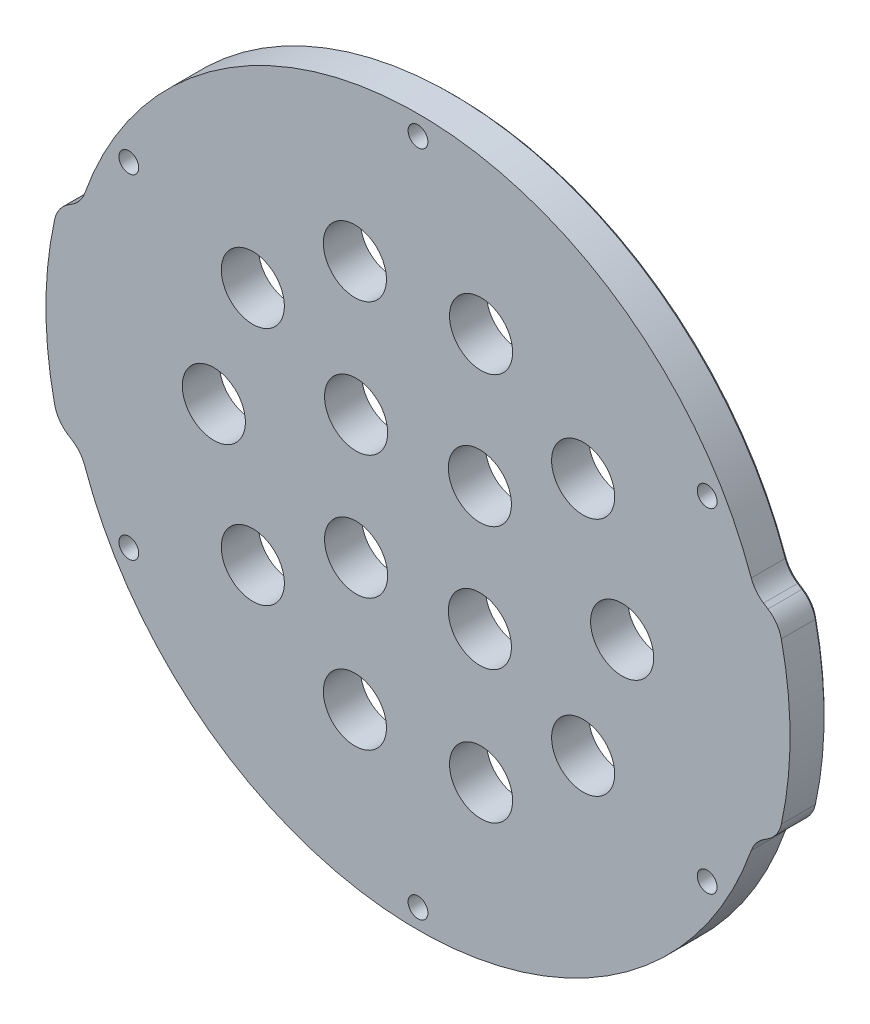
ISO-10303-21;
HEADER;
FILE_DESCRIPTION(('STEP AP214'),'2;1');
FILE_NAME('part.step','',(''),(''),'','','');
FILE_SCHEMA(('AUTOMOTIVE_DESIGN { 1 0 10303 214 1 1 1 1 }'));
ENDSEC;
DATA;
#1=APPLICATION_CONTEXT('core data for automotive mechanical design processes');
#2=APPLICATION_PROTOCOL_DEFINITION('international standard','automotive_design',2000,#1);
#3=PRODUCT_CONTEXT('',#1,'mechanical');
#4=PRODUCT('Part','Part','',(#3));
#5=PRODUCT_RELATED_PRODUCT_CATEGORY('part','',(#4));
#6=PRODUCT_DEFINITION_FORMATION('','',#4);
#7=PRODUCT_DEFINITION_CONTEXT('part definition',#1,'design');
#8=PRODUCT_DEFINITION('design','',#6,#7);
#9=PRODUCT_DEFINITION_SHAPE('','',#8);
#10=(LENGTH_UNIT() NAMED_UNIT(*) SI_UNIT(.MILLI.,.METRE.));
#11=(NAMED_UNIT(*) PLANE_ANGLE_UNIT() SI_UNIT($,.RADIAN.));
#12=(NAMED_UNIT(*) SI_UNIT($,.STERADIAN.) SOLID_ANGLE_UNIT());
#13=UNCERTAINTY_MEASURE_WITH_UNIT(LENGTH_MEASURE(1.E-05),#10,'distance_accuracy_value','');
#14=(GEOMETRIC_REPRESENTATION_CONTEXT(3) GLOBAL_UNCERTAINTY_ASSIGNED_CONTEXT((#13)) GLOBAL_UNIT_ASSIGNED_CONTEXT((#10,
#11,#12)) REPRESENTATION_CONTEXT('',''));
#15=CARTESIAN_POINT('',(0.,0.,0.));
#16=DIRECTION('',(0.,0.,1.));
#17=DIRECTION('',(1.,0.,0.));
#18=AXIS2_PLACEMENT_3D('',#15,#16,#17);
#19=CARTESIAN_POINT('',(0.,0.,6.));
#20=DIRECTION('',(0.,0.,1.));
#21=DIRECTION('',(1.,0.,0.));
#22=AXIS2_PLACEMENT_3D('',#19,#20,#21);
#23=PLANE('',#22);
#24=CARTESIAN_POINT('',(10.0055609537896,10.0055609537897,6.));
#25=DIRECTION('',(0.,0.,1.));
#26=DIRECTION('',(0.,-1.,0.));
#27=AXIS2_PLACEMENT_3D('',#24,#25,#26);
#28=CIRCLE('',#27,5.1);
#29=CARTESIAN_POINT('',(10.0055609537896,4.90556095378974,6.));
#30=VERTEX_POINT('',#29);
#31=EDGE_CURVE('E443',#30,#30,#28,.T.);
#32=ORIENTED_EDGE('',*,*,#31,.F.);
#33=EDGE_LOOP('',(#32));
#34=FACE_BOUND('',#33,.T.);
#35=CARTESIAN_POINT('',(10.0055609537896,-10.0055609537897,6.));
#36=DIRECTION('',(0.,0.,1.));
#37=DIRECTION('',(-1.,0.,0.));
#38=AXIS2_PLACEMENT_3D('',#35,#36,#37);
#39=CIRCLE('',#38,5.1);
#40=CARTESIAN_POINT('',(4.90556095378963,-10.0055609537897,6.));
#41=VERTEX_POINT('',#40);
#42=EDGE_CURVE('E433',#41,#41,#39,.T.);
#43=ORIENTED_EDGE('',*,*,#42,.F.);
#44=EDGE_LOOP('',(#43));
#45=FACE_BOUND('',#44,.T.);
#46=CARTESIAN_POINT('',(-10.0055609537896,-10.0055609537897,6.));
#47=DIRECTION('',(0.,0.,1.));
#48=DIRECTION('',(0.,1.,0.));
#49=AXIS2_PLACEMENT_3D('',#46,#47,#48);
#50=CIRCLE('',#49,5.1);
#51=CARTESIAN_POINT('',(-10.0055609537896,-4.90556095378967,6.));
#52=VERTEX_POINT('',#51);
#53=EDGE_CURVE('E430',#52,#52,#50,.T.);
#54=ORIENTED_EDGE('',*,*,#53,.F.);
#55=EDGE_LOOP('',(#54));
#56=FACE_BOUND('',#55,.T.);
#57=CARTESIAN_POINT('',(-10.0055609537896,10.0055609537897,6.));
#58=DIRECTION('',(0.,0.,1.));
#59=DIRECTION('',(1.,0.,0.));
#60=AXIS2_PLACEMENT_3D('',#57,#58,#59);
#61=CIRCLE('',#60,5.1);
#62=CARTESIAN_POINT('',(-4.90556095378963,10.0055609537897,6.));
#63=VERTEX_POINT('',#62);
#64=EDGE_CURVE('E427',#63,#63,#61,.T.);
#65=ORIENTED_EDGE('',*,*,#64,.F.);
#66=EDGE_LOOP('',(#65));
#67=FACE_BOUND('',#66,.T.);
#68=CARTESIAN_POINT('',(26.6975608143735,-19.3969133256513,6.));
#69=DIRECTION('',(0.,0.,1.));
#70=DIRECTION('',(0.809016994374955,-0.587785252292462,0.));
#71=AXIS2_PLACEMENT_3D('',#68,#69,#70);
#72=CIRCLE('',#71,5.1);
#73=CARTESIAN_POINT('',(30.8235474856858,-22.3946181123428,6.));
#74=VERTEX_POINT('',#73);
#75=EDGE_CURVE('E423',#74,#74,#72,.T.);
#76=ORIENTED_EDGE('',*,*,#75,.F.);
#77=EDGE_LOOP('',(#76));
#78=FACE_BOUND('',#77,.T.);
#79=CARTESIAN_POINT('',(10.1975608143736,-31.38486503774,6.));
#80=DIRECTION('',(0.,0.,1.));
#81=DIRECTION('',(0.309016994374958,-0.95105651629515,0.));
#82=AXIS2_PLACEMENT_3D('',#79,#80,#81);
#83=CIRCLE('',#82,5.1);
#84=CARTESIAN_POINT('',(11.7735474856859,-36.2352532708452,6.));
#85=VERTEX_POINT('',#84);
#86=EDGE_CURVE('E419',#85,#85,#83,.T.);
#87=ORIENTED_EDGE('',*,*,#86,.F.);
#88=EDGE_LOOP('',(#87));
#89=FACE_BOUND('',#88,.T.);
#90=CARTESIAN_POINT('',(-10.197560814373,-31.3848650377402,6.));
#91=DIRECTION('',(0.,0.,1.));
#92=DIRECTION('',(-0.309016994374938,-0.951056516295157,0.));
#93=AXIS2_PLACEMENT_3D('',#90,#91,#92);
#94=CIRCLE('',#93,5.1);
#95=CARTESIAN_POINT('',(-11.7735474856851,-36.2352532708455,6.));
#96=VERTEX_POINT('',#95);
#97=EDGE_CURVE('E415',#96,#96,#94,.T.);
#98=ORIENTED_EDGE('',*,*,#97,.F.);
#99=EDGE_LOOP('',(#98));
#100=FACE_BOUND('',#99,.T.);
#101=CARTESIAN_POINT('',(-26.6975608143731,-19.3969133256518,6.));
#102=DIRECTION('',(0.,0.,1.));
#103=DIRECTION('',(-0.809016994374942,-0.58778525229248,0.));
#104=AXIS2_PLACEMENT_3D('',#101,#102,#103);
#105=CIRCLE('',#104,5.1);
#106=CARTESIAN_POINT('',(-30.8235474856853,-22.3946181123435,6.));
#107=VERTEX_POINT('',#106);
#108=EDGE_CURVE('E411',#107,#107,#105,.T.);
#109=ORIENTED_EDGE('',*,*,#108,.F.);
#110=EDGE_LOOP('',(#109));
#111=FACE_BOUND('',#110,.T.);
#112=CARTESIAN_POINT('',(-33.,0.,6.));
#113=DIRECTION('',(0.,0.,1.));
#114=DIRECTION('',(-1.,0.,0.));
#115=AXIS2_PLACEMENT_3D('',#112,#113,#114);
#116=CIRCLE('',#115,5.1);
#117=CARTESIAN_POINT('',(-38.1,0.,6.));
#118=VERTEX_POINT('',#117);
#119=EDGE_CURVE('E407',#118,#118,#116,.T.);
#120=ORIENTED_EDGE('',*,*,#119,.F.);
#121=EDGE_LOOP('',(#120));
#122=FACE_BOUND('',#121,.T.);
#123=CARTESIAN_POINT('',(-26.6975608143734,19.3969133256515,6.));
#124=DIRECTION('',(0.,0.,1.));
#125=DIRECTION('',(-0.809016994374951,0.587785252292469,0.));
#126=AXIS2_PLACEMENT_3D('',#123,#124,#125);
#127=CIRCLE('',#126,5.1);
#128=CARTESIAN_POINT('',(-30.8235474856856,22.3946181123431,6.));
#129=VERTEX_POINT('',#128);
#130=EDGE_CURVE('E403',#129,#129,#127,.T.);
#131=ORIENTED_EDGE('',*,*,#130,.F.);
#132=EDGE_LOOP('',(#131));
#133=FACE_BOUND('',#132,.T.);
#134=CARTESIAN_POINT('',(-10.1975608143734,31.38486503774,6.));
#135=DIRECTION('',(0.,0.,1.));
#136=DIRECTION('',(-0.309016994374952,0.951056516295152,0.));
#137=AXIS2_PLACEMENT_3D('',#134,#135,#136);
#138=CIRCLE('',#137,5.1);
#139=CARTESIAN_POINT('',(-11.7735474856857,36.2352532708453,6.));
#140=VERTEX_POINT('',#139);
#141=EDGE_CURVE('E399',#140,#140,#138,.T.);
#142=ORIENTED_EDGE('',*,*,#141,.F.);
#143=EDGE_LOOP('',(#142));
#144=FACE_BOUND('',#143,.T.);
#145=CARTESIAN_POINT('',(10.1975608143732,31.3848650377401,6.));
#146=DIRECTION('',(0.,0.,1.));
#147=DIRECTION('',(0.309016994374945,0.951056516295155,0.));
#148=AXIS2_PLACEMENT_3D('',#145,#146,#147);
#149=CIRCLE('',#148,5.1);
#150=CARTESIAN_POINT('',(11.7735474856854,36.2352532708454,6.));
#151=VERTEX_POINT('',#150);
#152=EDGE_CURVE('E395',#151,#151,#149,.T.);
#153=ORIENTED_EDGE('',*,*,#152,.F.);
#154=EDGE_LOOP('',(#153));
#155=FACE_BOUND('',#154,.T.);
#156=CARTESIAN_POINT('',(26.6975608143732,19.3969133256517,6.));
#157=DIRECTION('',(0.,0.,1.));
#158=DIRECTION('',(0.809016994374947,0.587785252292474,0.));
#159=AXIS2_PLACEMENT_3D('',#156,#157,#158);
#160=CIRCLE('',#159,5.1);
#161=CARTESIAN_POINT('',(30.8235474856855,22.3946181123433,6.));
#162=VERTEX_POINT('',#161);
#163=EDGE_CURVE('E391',#162,#162,#160,.T.);
#164=ORIENTED_EDGE('',*,*,#163,.F.);
#165=EDGE_LOOP('',(#164));
#166=FACE_BOUND('',#165,.T.);
#167=CARTESIAN_POINT('',(33.,0.,6.));
#168=DIRECTION('',(0.,0.,1.));
#169=DIRECTION('',(1.,0.,0.));
#170=AXIS2_PLACEMENT_3D('',#167,#168,#169);
#171=CIRCLE('',#170,5.1);
#172=CARTESIAN_POINT('',(38.1,0.,6.));
#173=VERTEX_POINT('',#172);
#174=EDGE_CURVE('E387',#173,#173,#171,.T.);
#175=ORIENTED_EDGE('',*,*,#174,.F.);
#176=EDGE_LOOP('',(#175));
#177=FACE_BOUND('',#176,.T.);
#178=CARTESIAN_POINT('',(4.05749188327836E-12,-53.9749999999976,6.));
#179=DIRECTION('',(0.,0.,1.));
#180=DIRECTION('',(1.,0.,0.));
#181=AXIS2_PLACEMENT_3D('',#178,#179,#180);
#182=CIRCLE('',#181,1.6);
#183=CARTESIAN_POINT('',(1.60000000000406,-53.9749999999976,6.));
#184=VERTEX_POINT('',#183);
#185=EDGE_CURVE('E474',#184,#184,#182,.T.);
#186=ORIENTED_EDGE('',*,*,#185,.F.);
#187=EDGE_LOOP('',(#186));
#188=FACE_BOUND('',#187,.T.);
#189=CARTESIAN_POINT('',(46.7437211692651,26.9875000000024,6.));
#190=DIRECTION('',(0.,0.,1.));
#191=DIRECTION('',(1.,0.,0.));
#192=AXIS2_PLACEMENT_3D('',#189,#190,#191);
#193=CIRCLE('',#192,1.6);
#194=CARTESIAN_POINT('',(48.343721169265,26.9875000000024,6.));
#195=VERTEX_POINT('',#194);
#196=EDGE_CURVE('E486',#195,#195,#193,.T.);
#197=ORIENTED_EDGE('',*,*,#196,.F.);
#198=EDGE_LOOP('',(#197));
#199=FACE_BOUND('',#198,.T.);
#200=CARTESIAN_POINT('',(0.,53.975,6.));
#201=DIRECTION('',(0.,0.,1.));
#202=DIRECTION('',(1.,0.,0.));
#203=AXIS2_PLACEMENT_3D('',#200,#201,#202);
#204=CIRCLE('',#203,1.6);
#205=CARTESIAN_POINT('',(1.6,53.975,6.));
#206=VERTEX_POINT('',#205);
#207=EDGE_CURVE('E498',#206,#206,#204,.T.);
#208=ORIENTED_EDGE('',*,*,#207,.F.);
#209=EDGE_LOOP('',(#208));
#210=FACE_BOUND('',#209,.T.);
#211=DIRECTION('',(0.83836541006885,0.545108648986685,0.));
#212=VECTOR('',#211,1.);
#213=CARTESIAN_POINT('',(54.4047102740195,-17.5,6.));
#214=LINE('',#213,#212);
#215=CARTESIAN_POINT('',(55.8597455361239,-16.5539300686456,6.));
#216=VERTEX_POINT('',#215);
#217=CARTESIAN_POINT('',(56.5773734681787,-16.0873254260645,6.));
#218=VERTEX_POINT('',#217);
#219=EDGE_CURVE('E207',#216,#218,#214,.T.);
#220=ORIENTED_EDGE('',*,*,#219,.T.);
#221=CARTESIAN_POINT('',(53.8518302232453,-11.8954983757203,6.));
#222=DIRECTION('',(0.,0.,1.));
#223=DIRECTION('',(1.,0.,0.));
#224=AXIS2_PLACEMENT_3D('',#221,#222,#223);
#225=CIRCLE('',#224,5.);
#226=CARTESIAN_POINT('',(58.7341357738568,-12.97396604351,6.));
#227=VERTEX_POINT('',#226);
#228=EDGE_CURVE('E201',#218,#227,#225,.T.);
#229=ORIENTED_EDGE('',*,*,#228,.T.);
#230=CARTESIAN_POINT('',(0.,0.,6.));
#231=DIRECTION('',(0.,0.,1.));
#232=DIRECTION('',(1.,0.,0.));
#233=AXIS2_PLACEMENT_3D('',#230,#231,#232);
#234=CIRCLE('',#233,60.15);
#235=CARTESIAN_POINT('',(58.7341357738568,12.97396604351,6.));
#236=VERTEX_POINT('',#235);
#237=EDGE_CURVE('E204',#227,#236,#234,.T.);
#238=ORIENTED_EDGE('',*,*,#237,.T.);
#239=CARTESIAN_POINT('',(53.8518302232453,11.8954983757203,6.));
#240=DIRECTION('',(0.,0.,1.));
#241=DIRECTION('',(1.,0.,0.));
#242=AXIS2_PLACEMENT_3D('',#239,#240,#241);
#243=CIRCLE('',#242,5.);
#244=CARTESIAN_POINT('',(56.5773734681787,16.0873254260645,6.));
#245=VERTEX_POINT('',#244);
#246=EDGE_CURVE('E212',#236,#245,#243,.T.);
#247=ORIENTED_EDGE('',*,*,#246,.T.);
#248=DIRECTION('',(-0.83836541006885,0.545108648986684,0.));
#249=VECTOR('',#248,1.);
#250=CARTESIAN_POINT('',(54.4047102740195,17.5,6.));
#251=LINE('',#250,#249);
#252=CARTESIAN_POINT('',(55.8597455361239,16.5539300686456,6.));
#253=VERTEX_POINT('',#252);
#254=EDGE_CURVE('E221',#245,#253,#251,.T.);
#255=ORIENTED_EDGE('',*,*,#254,.T.);
#256=CARTESIAN_POINT('',(58.5852887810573,20.7457571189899,6.));
#257=DIRECTION('',(0.,0.,1.));
#258=DIRECTION('',(1.,0.,0.));
#259=AXIS2_PLACEMENT_3D('',#256,#257,#258);
#260=CIRCLE('',#259,5.);
#261=CARTESIAN_POINT('',(53.87207166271,19.0767501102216,6.));
#262=VERTEX_POINT('',#261);
#263=EDGE_CURVE('E270',#253,#262,#260,.F.);
#264=ORIENTED_EDGE('',*,*,#263,.T.);
#265=CARTESIAN_POINT('',(0.,0.,6.));
#266=DIRECTION('',(0.,0.,1.));
#267=DIRECTION('',(1.,0.,0.));
#268=AXIS2_PLACEMENT_3D('',#265,#266,#267);
#269=CIRCLE('',#268,57.15);
#270=CARTESIAN_POINT('',(-53.87207166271,19.0767501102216,6.));
#271=VERTEX_POINT('',#270);
#272=EDGE_CURVE('E501',#262,#271,#269,.T.);
#273=ORIENTED_EDGE('',*,*,#272,.T.);
#274=CARTESIAN_POINT('',(-58.5852887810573,20.7457571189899,6.));
#275=DIRECTION('',(0.,0.,1.));
#276=DIRECTION('',(1.,0.,0.));
#277=AXIS2_PLACEMENT_3D('',#274,#275,#276);
#278=CIRCLE('',#277,5.);
#279=CARTESIAN_POINT('',(-55.8597455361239,16.5539300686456,6.));
#280=VERTEX_POINT('',#279);
#281=EDGE_CURVE('E274',#271,#280,#278,.F.);
#282=ORIENTED_EDGE('',*,*,#281,.T.);
#283=DIRECTION('',(-0.83836541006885,-0.545108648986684,0.));
#284=VECTOR('',#283,1.);
#285=CARTESIAN_POINT('',(-54.4047102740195,17.5,6.));
#286=LINE('',#285,#284);
#287=CARTESIAN_POINT('',(-56.5773734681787,16.0873254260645,6.));
#288=VERTEX_POINT('',#287);
#289=EDGE_CURVE('E506',#280,#288,#286,.T.);
#290=ORIENTED_EDGE('',*,*,#289,.T.);
#291=CARTESIAN_POINT('',(-53.8518302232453,11.8954983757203,6.));
#292=DIRECTION('',(0.,0.,1.));
#293=DIRECTION('',(1.,0.,0.));
#294=AXIS2_PLACEMENT_3D('',#291,#292,#293);
#295=CIRCLE('',#294,5.);
#296=CARTESIAN_POINT('',(-58.7341357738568,12.97396604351,6.));
#297=VERTEX_POINT('',#296);
#298=EDGE_CURVE('E235',#288,#297,#295,.T.);
#299=ORIENTED_EDGE('',*,*,#298,.T.);
#300=CARTESIAN_POINT('',(0.,0.,6.));
#301=DIRECTION('',(0.,0.,1.));
#302=DIRECTION('',(1.,0.,0.));
#303=AXIS2_PLACEMENT_3D('',#300,#301,#302);
#304=CIRCLE('',#303,60.15);
#305=CARTESIAN_POINT('',(-58.7341357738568,-12.97396604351,6.));
#306=VERTEX_POINT('',#305);
#307=EDGE_CURVE('E509',#297,#306,#304,.T.);
#308=ORIENTED_EDGE('',*,*,#307,.T.);
#309=CARTESIAN_POINT('',(-53.8518302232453,-11.8954983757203,6.));
#310=DIRECTION('',(0.,0.,1.));
#311=DIRECTION('',(1.,0.,0.));
#312=AXIS2_PLACEMENT_3D('',#309,#310,#311);
#313=CIRCLE('',#312,5.);
#314=CARTESIAN_POINT('',(-56.5773734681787,-16.0873254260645,6.));
#315=VERTEX_POINT('',#314);
#316=EDGE_CURVE('E237',#306,#315,#313,.T.);
#317=ORIENTED_EDGE('',*,*,#316,.T.);
#318=DIRECTION('',(0.83836541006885,-0.545108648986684,0.));
#319=VECTOR('',#318,1.);
#320=CARTESIAN_POINT('',(-54.4047102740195,-17.5,6.));
#321=LINE('',#320,#319);
#322=CARTESIAN_POINT('',(-55.8597455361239,-16.5539300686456,6.));
#323=VERTEX_POINT('',#322);
#324=EDGE_CURVE('E512',#315,#323,#321,.T.);
#325=ORIENTED_EDGE('',*,*,#324,.T.);
#326=CARTESIAN_POINT('',(-58.5852887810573,-20.7457571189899,6.));
#327=DIRECTION('',(0.,0.,1.));
#328=DIRECTION('',(1.,0.,0.));
#329=AXIS2_PLACEMENT_3D('',#326,#327,#328);
#330=CIRCLE('',#329,5.);
#331=CARTESIAN_POINT('',(-53.87207166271,-19.0767501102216,6.));
#332=VERTEX_POINT('',#331);
#333=EDGE_CURVE('E272',#323,#332,#330,.F.);
#334=ORIENTED_EDGE('',*,*,#333,.T.);
#335=CARTESIAN_POINT('',(0.,0.,6.));
#336=DIRECTION('',(0.,0.,1.));
#337=DIRECTION('',(1.,0.,0.));
#338=AXIS2_PLACEMENT_3D('',#335,#336,#337);
#339=CIRCLE('',#338,57.15);
#340=CARTESIAN_POINT('',(53.87207166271,-19.0767501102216,6.));
#341=VERTEX_POINT('',#340);
#342=EDGE_CURVE('E515',#332,#341,#339,.T.);
#343=ORIENTED_EDGE('',*,*,#342,.T.);
#344=CARTESIAN_POINT('',(58.5852887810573,-20.7457571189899,6.));
#345=DIRECTION('',(0.,0.,1.));
#346=DIRECTION('',(1.,0.,0.));
#347=AXIS2_PLACEMENT_3D('',#344,#345,#346);
#348=CIRCLE('',#347,5.);
#349=EDGE_CURVE('E268',#341,#216,#348,.F.);
#350=ORIENTED_EDGE('',*,*,#349,.T.);
#351=EDGE_LOOP('',(#220,#229,#238,#247,#255,#264,#273,#282,#290,#299,#308,#317,#325,#334,#343,#350));
#352=FACE_BOUND('',#351,.T.);
#353=CARTESIAN_POINT('',(-46.743721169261,-26.9875,6.));
#354=DIRECTION('',(0.,0.,1.));
#355=DIRECTION('',(1.,0.,0.));
#356=AXIS2_PLACEMENT_3D('',#353,#354,#355);
#357=CIRCLE('',#356,1.6);
#358=CARTESIAN_POINT('',(-45.143721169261,-26.9875,6.));
#359=VERTEX_POINT('',#358);
#360=EDGE_CURVE('E492',#359,#359,#357,.T.);
#361=ORIENTED_EDGE('',*,*,#360,.F.);
#362=EDGE_LOOP('',(#361));
#363=FACE_BOUND('',#362,.T.);
#364=CARTESIAN_POINT('',(46.7437211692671,-26.9874999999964,6.));
#365=DIRECTION('',(0.,0.,1.));
#366=DIRECTION('',(1.,0.,0.));
#367=AXIS2_PLACEMENT_3D('',#364,#365,#366);
#368=CIRCLE('',#367,1.6);
#369=CARTESIAN_POINT('',(48.3437211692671,-26.9874999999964,6.));
#370=VERTEX_POINT('',#369);
#371=EDGE_CURVE('E480',#370,#370,#368,.T.);
#372=ORIENTED_EDGE('',*,*,#371,.F.);
#373=EDGE_LOOP('',(#372));
#374=FACE_BOUND('',#373,.T.);
#375=CARTESIAN_POINT('',(-46.743721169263,26.9874999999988,6.));
#376=DIRECTION('',(0.,0.,1.));
#377=DIRECTION('',(1.,0.,0.));
#378=AXIS2_PLACEMENT_3D('',#375,#376,#377);
#379=CIRCLE('',#378,1.6);
#380=CARTESIAN_POINT('',(-45.143721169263,26.9874999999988,6.));
#381=VERTEX_POINT('',#380);
#382=EDGE_CURVE('E468',#381,#381,#379,.T.);
#383=ORIENTED_EDGE('',*,*,#382,.F.);
#384=EDGE_LOOP('',(#383));
#385=FACE_BOUND('',#384,.T.);
#386=ADVANCED_FACE('F37',(#34,#45,#56,#67,#78,#89,#100,#111,#122,#133,#144,#155,#166,#177,#188,
#199,#210,#352,#363,#374,#385),#23,.T.);
#387=CARTESIAN_POINT('',(0.,0.,0.));
#388=DIRECTION('',(0.,0.,1.));
#389=DIRECTION('',(1.,0.,0.));
#390=AXIS2_PLACEMENT_3D('',#387,#388,#389);
#391=PLANE('',#390);
#392=CARTESIAN_POINT('',(10.0055609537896,10.0055609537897,0.));
#393=DIRECTION('',(0.,0.,1.));
#394=DIRECTION('',(1.,0.,0.));
#395=AXIS2_PLACEMENT_3D('',#392,#393,#394);
#396=CIRCLE('',#395,5.1);
#397=CARTESIAN_POINT('',(15.1055609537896,10.0055609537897,0.));
#398=VERTEX_POINT('',#397);
#399=EDGE_CURVE('E41',#398,#398,#396,.T.);
#400=ORIENTED_EDGE('',*,*,#399,.T.);
#401=EDGE_LOOP('',(#400));
#402=FACE_BOUND('',#401,.T.);
#403=CARTESIAN_POINT('',(10.0055609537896,-10.0055609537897,0.));
#404=DIRECTION('',(0.,0.,1.));
#405=DIRECTION('',(1.,0.,0.));
#406=AXIS2_PLACEMENT_3D('',#403,#404,#405);
#407=CIRCLE('',#406,5.1);
#408=CARTESIAN_POINT('',(15.1055609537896,-10.0055609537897,0.));
#409=VERTEX_POINT('',#408);
#410=EDGE_CURVE('E431',#409,#409,#407,.T.);
#411=ORIENTED_EDGE('',*,*,#410,.T.);
#412=EDGE_LOOP('',(#411));
#413=FACE_BOUND('',#412,.T.);
#414=CARTESIAN_POINT('',(-10.0055609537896,-10.0055609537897,0.));
#415=DIRECTION('',(0.,0.,1.));
#416=DIRECTION('',(1.,0.,0.));
#417=AXIS2_PLACEMENT_3D('',#414,#415,#416);
#418=CIRCLE('',#417,5.1);
#419=CARTESIAN_POINT('',(-4.90556095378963,-10.0055609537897,0.));
#420=VERTEX_POINT('',#419);
#421=EDGE_CURVE('E428',#420,#420,#418,.T.);
#422=ORIENTED_EDGE('',*,*,#421,.T.);
#423=EDGE_LOOP('',(#422));
#424=FACE_BOUND('',#423,.T.);
#425=CARTESIAN_POINT('',(-10.0055609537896,10.0055609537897,0.));
#426=DIRECTION('',(0.,0.,1.));
#427=DIRECTION('',(1.,0.,0.));
#428=AXIS2_PLACEMENT_3D('',#425,#426,#427);
#429=CIRCLE('',#428,5.1);
#430=CARTESIAN_POINT('',(-4.90556095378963,10.0055609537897,0.));
#431=VERTEX_POINT('',#430);
#432=EDGE_CURVE('E424',#431,#431,#429,.T.);
#433=ORIENTED_EDGE('',*,*,#432,.T.);
#434=EDGE_LOOP('',(#433));
#435=FACE_BOUND('',#434,.T.);
#436=CARTESIAN_POINT('',(26.6975608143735,-19.3969133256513,0.));
#437=DIRECTION('',(0.,0.,1.));
#438=DIRECTION('',(1.,0.,0.));
#439=AXIS2_PLACEMENT_3D('',#436,#437,#438);
#440=CIRCLE('',#439,5.1);
#441=CARTESIAN_POINT('',(31.7975608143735,-19.3969133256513,0.));
#442=VERTEX_POINT('',#441);
#443=EDGE_CURVE('E420',#442,#442,#440,.T.);
#444=ORIENTED_EDGE('',*,*,#443,.T.);
#445=EDGE_LOOP('',(#444));
#446=FACE_BOUND('',#445,.T.);
#447=CARTESIAN_POINT('',(10.1975608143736,-31.38486503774,0.));
#448=DIRECTION('',(0.,0.,1.));
#449=DIRECTION('',(1.,0.,0.));
#450=AXIS2_PLACEMENT_3D('',#447,#448,#449);
#451=CIRCLE('',#450,5.1);
#452=CARTESIAN_POINT('',(15.2975608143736,-31.38486503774,0.));
#453=VERTEX_POINT('',#452);
#454=EDGE_CURVE('E416',#453,#453,#451,.T.);
#455=ORIENTED_EDGE('',*,*,#454,.T.);
#456=EDGE_LOOP('',(#455));
#457=FACE_BOUND('',#456,.T.);
#458=CARTESIAN_POINT('',(-10.197560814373,-31.3848650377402,0.));
#459=DIRECTION('',(0.,0.,1.));
#460=DIRECTION('',(1.,0.,0.));
#461=AXIS2_PLACEMENT_3D('',#458,#459,#460);
#462=CIRCLE('',#461,5.1);
#463=CARTESIAN_POINT('',(-5.09756081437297,-31.3848650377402,0.));
#464=VERTEX_POINT('',#463);
#465=EDGE_CURVE('E412',#464,#464,#462,.T.);
#466=ORIENTED_EDGE('',*,*,#465,.T.);
#467=EDGE_LOOP('',(#466));
#468=FACE_BOUND('',#467,.T.);
#469=CARTESIAN_POINT('',(-26.6975608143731,-19.3969133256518,0.));
#470=DIRECTION('',(0.,0.,1.));
#471=DIRECTION('',(1.,0.,0.));
#472=AXIS2_PLACEMENT_3D('',#469,#470,#471);
#473=CIRCLE('',#472,5.1);
#474=CARTESIAN_POINT('',(-21.5975608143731,-19.3969133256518,0.));
#475=VERTEX_POINT('',#474);
#476=EDGE_CURVE('E408',#475,#475,#473,.T.);
#477=ORIENTED_EDGE('',*,*,#476,.T.);
#478=EDGE_LOOP('',(#477));
#479=FACE_BOUND('',#478,.T.);
#480=CARTESIAN_POINT('',(-33.,0.,0.));
#481=DIRECTION('',(0.,0.,1.));
#482=DIRECTION('',(1.,0.,0.));
#483=AXIS2_PLACEMENT_3D('',#480,#481,#482);
#484=CIRCLE('',#483,5.1);
#485=CARTESIAN_POINT('',(-27.9,0.,0.));
#486=VERTEX_POINT('',#485);
#487=EDGE_CURVE('E404',#486,#486,#484,.T.);
#488=ORIENTED_EDGE('',*,*,#487,.T.);
#489=EDGE_LOOP('',(#488));
#490=FACE_BOUND('',#489,.T.);
#491=CARTESIAN_POINT('',(-26.6975608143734,19.3969133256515,0.));
#492=DIRECTION('',(0.,0.,1.));
#493=DIRECTION('',(1.,0.,0.));
#494=AXIS2_PLACEMENT_3D('',#491,#492,#493);
#495=CIRCLE('',#494,5.1);
#496=CARTESIAN_POINT('',(-21.5975608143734,19.3969133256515,0.));
#497=VERTEX_POINT('',#496);
#498=EDGE_CURVE('E400',#497,#497,#495,.T.);
#499=ORIENTED_EDGE('',*,*,#498,.T.);
#500=EDGE_LOOP('',(#499));
#501=FACE_BOUND('',#500,.T.);
#502=CARTESIAN_POINT('',(-10.1975608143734,31.38486503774,0.));
#503=DIRECTION('',(0.,0.,1.));
#504=DIRECTION('',(1.,0.,0.));
#505=AXIS2_PLACEMENT_3D('',#502,#503,#504);
#506=CIRCLE('',#505,5.1);
#507=CARTESIAN_POINT('',(-5.0975608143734,31.38486503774,0.));
#508=VERTEX_POINT('',#507);
#509=EDGE_CURVE('E396',#508,#508,#506,.T.);
#510=ORIENTED_EDGE('',*,*,#509,.T.);
#511=EDGE_LOOP('',(#510));
#512=FACE_BOUND('',#511,.T.);
#513=CARTESIAN_POINT('',(10.1975608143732,31.3848650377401,0.));
#514=DIRECTION('',(0.,0.,1.));
#515=DIRECTION('',(1.,0.,0.));
#516=AXIS2_PLACEMENT_3D('',#513,#514,#515);
#517=CIRCLE('',#516,5.1);
#518=CARTESIAN_POINT('',(15.2975608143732,31.3848650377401,0.));
#519=VERTEX_POINT('',#518);
#520=EDGE_CURVE('E392',#519,#519,#517,.T.);
#521=ORIENTED_EDGE('',*,*,#520,.T.);
#522=EDGE_LOOP('',(#521));
#523=FACE_BOUND('',#522,.T.);
#524=CARTESIAN_POINT('',(26.6975608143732,19.3969133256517,0.));
#525=DIRECTION('',(0.,0.,1.));
#526=DIRECTION('',(1.,0.,0.));
#527=AXIS2_PLACEMENT_3D('',#524,#525,#526);
#528=CIRCLE('',#527,5.1);
#529=CARTESIAN_POINT('',(31.7975608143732,19.3969133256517,0.));
#530=VERTEX_POINT('',#529);
#531=EDGE_CURVE('E388',#530,#530,#528,.T.);
#532=ORIENTED_EDGE('',*,*,#531,.T.);
#533=EDGE_LOOP('',(#532));
#534=FACE_BOUND('',#533,.T.);
#535=CARTESIAN_POINT('',(33.,0.,0.));
#536=DIRECTION('',(0.,0.,1.));
#537=DIRECTION('',(1.,0.,0.));
#538=AXIS2_PLACEMENT_3D('',#535,#536,#537);
#539=CIRCLE('',#538,5.1);
#540=CARTESIAN_POINT('',(38.1,0.,0.));
#541=VERTEX_POINT('',#540);
#542=EDGE_CURVE('E340',#541,#541,#539,.T.);
#543=ORIENTED_EDGE('',*,*,#542,.T.);
#544=EDGE_LOOP('',(#543));
#545=FACE_BOUND('',#544,.T.);
#546=CARTESIAN_POINT('',(58.5852887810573,-20.7457571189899,0.));
#547=DIRECTION('',(0.,0.,1.));
#548=DIRECTION('',(1.,0.,0.));
#549=AXIS2_PLACEMENT_3D('',#546,#547,#548);
#550=CIRCLE('',#549,5.50000000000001);
#551=CARTESIAN_POINT('',(55.5871912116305,-16.1347473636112,0.));
#552=VERTEX_POINT('',#551);
#553=CARTESIAN_POINT('',(53.4007499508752,-18.9098494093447,0.));
#554=VERTEX_POINT('',#553);
#555=EDGE_CURVE('E307',#552,#554,#550,.T.);
#556=ORIENTED_EDGE('',*,*,#555,.T.);
#557=CARTESIAN_POINT('',(0.,0.,0.));
#558=DIRECTION('',(0.,0.,1.));
#559=DIRECTION('',(1.,0.,0.));
#560=AXIS2_PLACEMENT_3D('',#557,#558,#559);
#561=CIRCLE('',#560,56.65);
#562=CARTESIAN_POINT('',(-53.4007499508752,-18.9098494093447,0.));
#563=VERTEX_POINT('',#562);
#564=EDGE_CURVE('E309',#554,#563,#561,.F.);
#565=ORIENTED_EDGE('',*,*,#564,.T.);
#566=CARTESIAN_POINT('',(-58.5852887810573,-20.7457571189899,0.));
#567=DIRECTION('',(0.,0.,1.));
#568=DIRECTION('',(1.,0.,0.));
#569=AXIS2_PLACEMENT_3D('',#566,#567,#568);
#570=CIRCLE('',#569,5.50000000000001);
#571=CARTESIAN_POINT('',(-55.5871912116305,-16.1347473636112,0.));
#572=VERTEX_POINT('',#571);
#573=EDGE_CURVE('E305',#563,#572,#570,.T.);
#574=ORIENTED_EDGE('',*,*,#573,.T.);
#575=DIRECTION('',(-0.83836541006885,0.545108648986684,0.));
#576=VECTOR('',#575,1.);
#577=CARTESIAN_POINT('',(-23.8909525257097,-36.7437725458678,0.));
#578=LINE('',#577,#576);
#579=CARTESIAN_POINT('',(-56.3048191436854,-15.6681427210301,0.));
#580=VERTEX_POINT('',#579);
#581=EDGE_CURVE('E301',#572,#580,#578,.T.);
#582=ORIENTED_EDGE('',*,*,#581,.T.);
#583=CARTESIAN_POINT('',(-53.8518302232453,-11.8954983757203,0.));
#584=DIRECTION('',(0.,0.,1.));
#585=DIRECTION('',(1.,0.,0.));
#586=AXIS2_PLACEMENT_3D('',#583,#584,#585);
#587=CIRCLE('',#586,4.5);
#588=CARTESIAN_POINT('',(-58.2459052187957,-12.866119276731,0.));
#589=VERTEX_POINT('',#588);
#590=EDGE_CURVE('E297',#580,#589,#587,.F.);
#591=ORIENTED_EDGE('',*,*,#590,.T.);
#592=CARTESIAN_POINT('',(0.,0.,0.));
#593=DIRECTION('',(0.,0.,1.));
#594=DIRECTION('',(1.,0.,0.));
#595=AXIS2_PLACEMENT_3D('',#592,#593,#594);
#596=CIRCLE('',#595,59.65);
#597=CARTESIAN_POINT('',(-58.2459052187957,12.866119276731,0.));
#598=VERTEX_POINT('',#597);
#599=EDGE_CURVE('E293',#589,#598,#596,.F.);
#600=ORIENTED_EDGE('',*,*,#599,.T.);
#601=CARTESIAN_POINT('',(-53.8518302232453,11.8954983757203,0.));
#602=DIRECTION('',(0.,0.,1.));
#603=DIRECTION('',(1.,0.,0.));
#604=AXIS2_PLACEMENT_3D('',#601,#602,#603);
#605=CIRCLE('',#604,4.49999999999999);
#606=CARTESIAN_POINT('',(-56.3048191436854,15.6681427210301,0.));
#607=VERTEX_POINT('',#606);
#608=EDGE_CURVE('E289',#598,#607,#605,.F.);
#609=ORIENTED_EDGE('',*,*,#608,.T.);
#610=DIRECTION('',(0.83836541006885,0.545108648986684,0.));
#611=VECTOR('',#610,1.);
#612=CARTESIAN_POINT('',(-23.8909525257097,36.7437725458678,0.));
#613=LINE('',#612,#611);
#614=CARTESIAN_POINT('',(-55.5871912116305,16.1347473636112,0.));
#615=VERTEX_POINT('',#614);
#616=EDGE_CURVE('E285',#607,#615,#613,.T.);
#617=ORIENTED_EDGE('',*,*,#616,.T.);
#618=CARTESIAN_POINT('',(-58.5852887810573,20.7457571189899,0.));
#619=DIRECTION('',(0.,0.,1.));
#620=DIRECTION('',(1.,0.,0.));
#621=AXIS2_PLACEMENT_3D('',#618,#619,#620);
#622=CIRCLE('',#621,5.50000000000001);
#623=CARTESIAN_POINT('',(-53.4007499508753,18.9098494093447,0.));
#624=VERTEX_POINT('',#623);
#625=EDGE_CURVE('E281',#615,#624,#622,.T.);
#626=ORIENTED_EDGE('',*,*,#625,.T.);
#627=CARTESIAN_POINT('',(0.,0.,0.));
#628=DIRECTION('',(0.,0.,1.));
#629=DIRECTION('',(1.,0.,0.));
#630=AXIS2_PLACEMENT_3D('',#627,#628,#629);
#631=CIRCLE('',#630,56.65);
#632=CARTESIAN_POINT('',(53.4007499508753,18.9098494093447,0.));
#633=VERTEX_POINT('',#632);
#634=EDGE_CURVE('E279',#624,#633,#631,.F.);
#635=ORIENTED_EDGE('',*,*,#634,.T.);
#636=CARTESIAN_POINT('',(58.5852887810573,20.7457571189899,0.));
#637=DIRECTION('',(0.,0.,1.));
#638=DIRECTION('',(1.,0.,0.));
#639=AXIS2_PLACEMENT_3D('',#636,#637,#638);
#640=CIRCLE('',#639,5.50000000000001);
#641=CARTESIAN_POINT('',(55.5871912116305,16.1347473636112,0.));
#642=VERTEX_POINT('',#641);
#643=EDGE_CURVE('E283',#633,#642,#640,.T.);
#644=ORIENTED_EDGE('',*,*,#643,.T.);
#645=DIRECTION('',(0.83836541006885,-0.545108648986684,0.));
#646=VECTOR('',#645,1.);
#647=CARTESIAN_POINT('',(23.8909525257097,36.7437725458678,0.));
#648=LINE('',#647,#646);
#649=CARTESIAN_POINT('',(56.3048191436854,15.6681427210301,0.));
#650=VERTEX_POINT('',#649);
#651=EDGE_CURVE('E287',#642,#650,#648,.T.);
#652=ORIENTED_EDGE('',*,*,#651,.T.);
#653=CARTESIAN_POINT('',(53.8518302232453,11.8954983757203,0.));
#654=DIRECTION('',(0.,0.,1.));
#655=DIRECTION('',(1.,0.,0.));
#656=AXIS2_PLACEMENT_3D('',#653,#654,#655);
#657=CIRCLE('',#656,4.5);
#658=CARTESIAN_POINT('',(58.2459052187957,12.866119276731,0.));
#659=VERTEX_POINT('',#658);
#660=EDGE_CURVE('E291',#650,#659,#657,.F.);
#661=ORIENTED_EDGE('',*,*,#660,.T.);
#662=CARTESIAN_POINT('',(0.,0.,0.));
#663=DIRECTION('',(0.,0.,1.));
#664=DIRECTION('',(1.,0.,0.));
#665=AXIS2_PLACEMENT_3D('',#662,#663,#664);
#666=CIRCLE('',#665,59.65);
#667=CARTESIAN_POINT('',(58.2459052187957,-12.866119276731,0.));
#668=VERTEX_POINT('',#667);
#669=EDGE_CURVE('E295',#659,#668,#666,.F.);
#670=ORIENTED_EDGE('',*,*,#669,.T.);
#671=CARTESIAN_POINT('',(53.8518302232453,-11.8954983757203,0.));
#672=DIRECTION('',(0.,0.,1.));
#673=DIRECTION('',(1.,0.,0.));
#674=AXIS2_PLACEMENT_3D('',#671,#672,#673);
#675=CIRCLE('',#674,4.5);
#676=CARTESIAN_POINT('',(56.3048191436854,-15.6681427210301,0.));
#677=VERTEX_POINT('',#676);
#678=EDGE_CURVE('E299',#668,#677,#675,.F.);
#679=ORIENTED_EDGE('',*,*,#678,.T.);
#680=DIRECTION('',(-0.83836541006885,-0.545108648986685,0.));
#681=VECTOR('',#680,1.);
#682=CARTESIAN_POINT('',(23.8909525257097,-36.7437725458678,0.));
#683=LINE('',#682,#681);
#684=EDGE_CURVE('E303',#677,#552,#683,.T.);
#685=ORIENTED_EDGE('',*,*,#684,.T.);
#686=EDGE_LOOP('',(#556,#565,#574,#582,#591,#600,#609,#617,#626,#635,#644,#652,#661,#670,#679,#685));
#687=FACE_BOUND('',#686,.T.);
#688=CARTESIAN_POINT('',(4.05749188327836E-12,-53.9749999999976,0.));
#689=DIRECTION('',(0.,0.,1.));
#690=DIRECTION('',(1.,0.,0.));
#691=AXIS2_PLACEMENT_3D('',#688,#689,#690);
#692=CIRCLE('',#691,1.6);
#693=CARTESIAN_POINT('',(1.60000000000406,-53.9749999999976,0.));
#694=VERTEX_POINT('',#693);
#695=EDGE_CURVE('E471',#694,#694,#692,.T.);
#696=ORIENTED_EDGE('',*,*,#695,.T.);
#697=EDGE_LOOP('',(#696));
#698=FACE_BOUND('',#697,.T.);
#699=CARTESIAN_POINT('',(46.7437211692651,26.9875000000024,0.));
#700=DIRECTION('',(0.,0.,1.));
#701=DIRECTION('',(1.,0.,0.));
#702=AXIS2_PLACEMENT_3D('',#699,#700,#701);
#703=CIRCLE('',#702,1.6);
#704=CARTESIAN_POINT('',(48.343721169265,26.9875000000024,0.));
#705=VERTEX_POINT('',#704);
#706=EDGE_CURVE('E483',#705,#705,#703,.T.);
#707=ORIENTED_EDGE('',*,*,#706,.T.);
#708=EDGE_LOOP('',(#707));
#709=FACE_BOUND('',#708,.T.);
#710=CARTESIAN_POINT('',(0.,53.975,0.));
#711=DIRECTION('',(0.,0.,1.));
#712=DIRECTION('',(1.,0.,0.));
#713=AXIS2_PLACEMENT_3D('',#710,#711,#712);
#714=CIRCLE('',#713,1.6);
#715=CARTESIAN_POINT('',(1.6,53.975,0.));
#716=VERTEX_POINT('',#715);
#717=EDGE_CURVE('E495',#716,#716,#714,.T.);
#718=ORIENTED_EDGE('',*,*,#717,.T.);
#719=EDGE_LOOP('',(#718));
#720=FACE_BOUND('',#719,.T.);
#721=CARTESIAN_POINT('',(-46.743721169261,-26.9875,0.));
#722=DIRECTION('',(0.,0.,1.));
#723=DIRECTION('',(1.,0.,0.));
#724=AXIS2_PLACEMENT_3D('',#721,#722,#723);
#725=CIRCLE('',#724,1.6);
#726=CARTESIAN_POINT('',(-45.143721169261,-26.9875,0.));
#727=VERTEX_POINT('',#726);
#728=EDGE_CURVE('E489',#727,#727,#725,.T.);
#729=ORIENTED_EDGE('',*,*,#728,.T.);
#730=EDGE_LOOP('',(#729));
#731=FACE_BOUND('',#730,.T.);
#732=CARTESIAN_POINT('',(46.7437211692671,-26.9874999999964,0.));
#733=DIRECTION('',(0.,0.,1.));
#734=DIRECTION('',(1.,0.,0.));
#735=AXIS2_PLACEMENT_3D('',#732,#733,#734);
#736=CIRCLE('',#735,1.6);
#737=CARTESIAN_POINT('',(48.3437211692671,-26.9874999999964,0.));
#738=VERTEX_POINT('',#737);
#739=EDGE_CURVE('E477',#738,#738,#736,.T.);
#740=ORIENTED_EDGE('',*,*,#739,.T.);
#741=EDGE_LOOP('',(#740));
#742=FACE_BOUND('',#741,.T.);
#743=CARTESIAN_POINT('',(-46.743721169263,26.9874999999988,0.));
#744=DIRECTION('',(0.,0.,1.));
#745=DIRECTION('',(1.,0.,0.));
#746=AXIS2_PLACEMENT_3D('',#743,#744,#745);
#747=CIRCLE('',#746,1.6);
#748=CARTESIAN_POINT('',(-45.143721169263,26.9874999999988,0.));
#749=VERTEX_POINT('',#748);
#750=EDGE_CURVE('E384',#749,#749,#747,.T.);
#751=ORIENTED_EDGE('',*,*,#750,.T.);
#752=EDGE_LOOP('',(#751));
#753=FACE_BOUND('',#752,.T.);
#754=ADVANCED_FACE('F537',(#402,#413,#424,#435,#446,#457,#468,#479,#490,#501,#512,#523,#534,
#545,#687,#698,#709,#720,#731,#742,#753),#391,.F.);
#755=CARTESIAN_POINT('',(0.,0.,6.));
#756=DIRECTION('',(0.,0.,-1.));
#757=DIRECTION('',(-1.,0.,0.));
#758=AXIS2_PLACEMENT_3D('',#755,#756,#757);
#759=CYLINDRICAL_SURFACE('',#758,57.15);
#760=DIRECTION('',(0.,0.,-1.));
#761=VECTOR('',#760,1.);
#762=CARTESIAN_POINT('',(53.87207166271,19.0767501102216,6.));
#763=LINE('',#762,#761);
#764=CARTESIAN_POINT('',(53.87207166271,19.0767501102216,0.5));
#765=VERTEX_POINT('',#764);
#766=EDGE_CURVE('E251',#262,#765,#763,.T.);
#767=ORIENTED_EDGE('',*,*,#766,.T.);
#768=CARTESIAN_POINT('',(0.,0.,0.5));
#769=DIRECTION('',(0.,0.,1.));
#770=DIRECTION('',(1.,0.,0.));
#771=AXIS2_PLACEMENT_3D('',#768,#769,#770);
#772=CIRCLE('',#771,57.15);
#773=CARTESIAN_POINT('',(-53.87207166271,19.0767501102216,0.5));
#774=VERTEX_POINT('',#773);
#775=EDGE_CURVE('E11',#765,#774,#772,.T.);
#776=ORIENTED_EDGE('',*,*,#775,.T.);
#777=DIRECTION('',(0.,0.,-1.));
#778=VECTOR('',#777,1.);
#779=CARTESIAN_POINT('',(-53.87207166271,19.0767501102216,6.));
#780=LINE('',#779,#778);
#781=EDGE_CURVE('E249',#774,#271,#780,.F.);
#782=ORIENTED_EDGE('',*,*,#781,.T.);
#783=ORIENTED_EDGE('',*,*,#272,.F.);
#784=EDGE_LOOP('',(#767,#776,#782,#783));
#785=FACE_BOUND('',#784,.T.);
#786=ADVANCED_FACE('F525',(#785),#759,.T.);
#787=CARTESIAN_POINT('',(-54.4047102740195,17.5,6.));
#788=DIRECTION('',(0.545108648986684,-0.83836541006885,0.));
#789=DIRECTION('',(0.83836541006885,0.545108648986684,0.));
#790=AXIS2_PLACEMENT_3D('',#787,#788,#789);
#791=PLANE('',#790);
#792=DIRECTION('',(0.,0.,1.));
#793=VECTOR('',#792,1.);
#794=CARTESIAN_POINT('',(-55.8597455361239,16.5539300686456,0.));
#795=LINE('',#794,#793);
#796=CARTESIAN_POINT('',(-55.8597455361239,16.5539300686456,0.5));
#797=VERTEX_POINT('',#796);
#798=EDGE_CURVE('E263',#280,#797,#795,.F.);
#799=ORIENTED_EDGE('',*,*,#798,.T.);
#800=DIRECTION('',(-0.83836541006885,-0.545108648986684,0.));
#801=VECTOR('',#800,1.);
#802=CARTESIAN_POINT('',(-54.4047102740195,17.5,0.5));
#803=LINE('',#802,#801);
#804=CARTESIAN_POINT('',(-56.5773734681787,16.0873254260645,0.5));
#805=VERTEX_POINT('',#804);
#806=EDGE_CURVE('E333',#797,#805,#803,.T.);
#807=ORIENTED_EDGE('',*,*,#806,.T.);
#808=DIRECTION('',(0.,0.,-1.));
#809=VECTOR('',#808,1.);
#810=CARTESIAN_POINT('',(-56.5773734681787,16.0873254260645,6.));
#811=LINE('',#810,#809);
#812=EDGE_CURVE('E266',#805,#288,#811,.F.);
#813=ORIENTED_EDGE('',*,*,#812,.T.);
#814=ORIENTED_EDGE('',*,*,#289,.F.);
#815=EDGE_LOOP('',(#799,#807,#813,#814));
#816=FACE_BOUND('',#815,.T.);
#817=ADVANCED_FACE('F551',(#816),#791,.F.);
#818=CARTESIAN_POINT('',(0.,0.,6.));
#819=DIRECTION('',(0.,0.,-1.));
#820=DIRECTION('',(-1.,0.,0.));
#821=AXIS2_PLACEMENT_3D('',#818,#819,#820);
#822=CYLINDRICAL_SURFACE('',#821,60.15);
#823=DIRECTION('',(0.,0.,-1.));
#824=VECTOR('',#823,1.);
#825=CARTESIAN_POINT('',(-58.7341357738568,12.97396604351,6.));
#826=LINE('',#825,#824);
#827=CARTESIAN_POINT('',(-58.7341357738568,12.97396604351,0.5));
#828=VERTEX_POINT('',#827);
#829=EDGE_CURVE('E258',#297,#828,#826,.T.);
#830=ORIENTED_EDGE('',*,*,#829,.T.);
#831=CARTESIAN_POINT('',(0.,0.,0.5));
#832=DIRECTION('',(0.,0.,1.));
#833=DIRECTION('',(1.,0.,0.));
#834=AXIS2_PLACEMENT_3D('',#831,#832,#833);
#835=CIRCLE('',#834,60.15);
#836=CARTESIAN_POINT('',(-58.7341357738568,-12.97396604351,0.5));
#837=VERTEX_POINT('',#836);
#838=EDGE_CURVE('E325',#828,#837,#835,.T.);
#839=ORIENTED_EDGE('',*,*,#838,.T.);
#840=DIRECTION('',(0.,0.,-1.));
#841=VECTOR('',#840,1.);
#842=CARTESIAN_POINT('',(-58.7341357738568,-12.97396604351,6.));
#843=LINE('',#842,#841);
#844=EDGE_CURVE('E261',#837,#306,#843,.F.);
#845=ORIENTED_EDGE('',*,*,#844,.T.);
#846=ORIENTED_EDGE('',*,*,#307,.F.);
#847=EDGE_LOOP('',(#830,#839,#845,#846));
#848=FACE_BOUND('',#847,.T.);
#849=ADVANCED_FACE('F562',(#848),#822,.T.);
#850=CARTESIAN_POINT('',(-54.4047102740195,-17.5,6.));
#851=DIRECTION('',(0.545108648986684,0.83836541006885,0.));
#852=DIRECTION('',(-0.83836541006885,0.545108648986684,0.));
#853=AXIS2_PLACEMENT_3D('',#850,#851,#852);
#854=PLANE('',#853);
#855=DIRECTION('',(0.,0.,-1.));
#856=VECTOR('',#855,1.);
#857=CARTESIAN_POINT('',(-56.5773734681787,-16.0873254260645,6.));
#858=LINE('',#857,#856);
#859=CARTESIAN_POINT('',(-56.5773734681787,-16.0873254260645,0.5));
#860=VERTEX_POINT('',#859);
#861=EDGE_CURVE('E253',#315,#860,#858,.T.);
#862=ORIENTED_EDGE('',*,*,#861,.T.);
#863=DIRECTION('',(0.83836541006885,-0.545108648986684,0.));
#864=VECTOR('',#863,1.);
#865=CARTESIAN_POINT('',(-54.4047102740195,-17.5,0.5));
#866=LINE('',#865,#864);
#867=CARTESIAN_POINT('',(-55.8597455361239,-16.5539300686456,0.5));
#868=VERTEX_POINT('',#867);
#869=EDGE_CURVE('E318',#860,#868,#866,.T.);
#870=ORIENTED_EDGE('',*,*,#869,.T.);
#871=DIRECTION('',(0.,0.,1.));
#872=VECTOR('',#871,1.);
#873=CARTESIAN_POINT('',(-55.8597455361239,-16.5539300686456,6.));
#874=LINE('',#873,#872);
#875=EDGE_CURVE('E256',#868,#323,#874,.T.);
#876=ORIENTED_EDGE('',*,*,#875,.T.);
#877=ORIENTED_EDGE('',*,*,#324,.F.);
#878=EDGE_LOOP('',(#862,#870,#876,#877));
#879=FACE_BOUND('',#878,.T.);
#880=ADVANCED_FACE('F584',(#879),#854,.F.);
#881=CARTESIAN_POINT('',(0.,0.,6.));
#882=DIRECTION('',(0.,0.,-1.));
#883=DIRECTION('',(-1.,0.,0.));
#884=AXIS2_PLACEMENT_3D('',#881,#882,#883);
#885=CYLINDRICAL_SURFACE('',#884,57.15);
#886=DIRECTION('',(0.,0.,-1.));
#887=VECTOR('',#886,1.);
#888=CARTESIAN_POINT('',(-53.87207166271,-19.0767501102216,6.));
#889=LINE('',#888,#887);
#890=CARTESIAN_POINT('',(-53.87207166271,-19.0767501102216,0.5));
#891=VERTEX_POINT('',#890);
#892=EDGE_CURVE('E211',#332,#891,#889,.T.);
#893=ORIENTED_EDGE('',*,*,#892,.T.);
#894=CARTESIAN_POINT('',(0.,0.,0.5));
#895=DIRECTION('',(0.,0.,1.));
#896=DIRECTION('',(1.,0.,0.));
#897=AXIS2_PLACEMENT_3D('',#894,#895,#896);
#898=CIRCLE('',#897,57.15);
#899=CARTESIAN_POINT('',(53.87207166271,-19.0767501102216,0.5));
#900=VERTEX_POINT('',#899);
#901=EDGE_CURVE('E276',#891,#900,#898,.T.);
#902=ORIENTED_EDGE('',*,*,#901,.T.);
#903=DIRECTION('',(0.,0.,-1.));
#904=VECTOR('',#903,1.);
#905=CARTESIAN_POINT('',(53.87207166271,-19.0767501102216,6.));
#906=LINE('',#905,#904);
#907=EDGE_CURVE('E242',#900,#341,#906,.F.);
#908=ORIENTED_EDGE('',*,*,#907,.T.);
#909=ORIENTED_EDGE('',*,*,#342,.F.);
#910=EDGE_LOOP('',(#893,#902,#908,#909));
#911=FACE_BOUND('',#910,.T.);
#912=ADVANCED_FACE('F595',(#911),#885,.T.);
#913=CARTESIAN_POINT('',(54.4047102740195,-17.5,6.));
#914=DIRECTION('',(-0.545108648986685,0.83836541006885,0.));
#915=DIRECTION('',(-0.83836541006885,-0.545108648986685,0.));
#916=AXIS2_PLACEMENT_3D('',#913,#914,#915);
#917=PLANE('',#916);
#918=DIRECTION('',(0.,0.,1.));
#919=VECTOR('',#918,1.);
#920=CARTESIAN_POINT('',(55.8597455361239,-16.5539300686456,0.));
#921=LINE('',#920,#919);
#922=CARTESIAN_POINT('',(55.8597455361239,-16.5539300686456,0.5));
#923=VERTEX_POINT('',#922);
#924=EDGE_CURVE('E226',#216,#923,#921,.F.);
#925=ORIENTED_EDGE('',*,*,#924,.T.);
#926=DIRECTION('',(0.83836541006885,0.545108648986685,0.));
#927=VECTOR('',#926,1.);
#928=CARTESIAN_POINT('',(54.4047102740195,-17.5,0.5));
#929=LINE('',#928,#927);
#930=CARTESIAN_POINT('',(56.5773734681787,-16.0873254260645,0.5));
#931=VERTEX_POINT('',#930);
#932=EDGE_CURVE('E316',#923,#931,#929,.T.);
#933=ORIENTED_EDGE('',*,*,#932,.T.);
#934=DIRECTION('',(0.,0.,-1.));
#935=VECTOR('',#934,1.);
#936=CARTESIAN_POINT('',(56.5773734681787,-16.0873254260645,6.));
#937=LINE('',#936,#935);
#938=EDGE_CURVE('E229',#931,#218,#937,.F.);
#939=ORIENTED_EDGE('',*,*,#938,.T.);
#940=ORIENTED_EDGE('',*,*,#219,.F.);
#941=EDGE_LOOP('',(#925,#933,#939,#940));
#942=FACE_BOUND('',#941,.T.);
#943=ADVANCED_FACE('F616',(#942),#917,.F.);
#944=CARTESIAN_POINT('',(0.,0.,6.));
#945=DIRECTION('',(0.,0.,-1.));
#946=DIRECTION('',(-1.,0.,0.));
#947=AXIS2_PLACEMENT_3D('',#944,#945,#946);
#948=CYLINDRICAL_SURFACE('',#947,60.15);
#949=DIRECTION('',(0.,0.,-1.));
#950=VECTOR('',#949,1.);
#951=CARTESIAN_POINT('',(58.7341357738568,-12.97396604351,6.));
#952=LINE('',#951,#950);
#953=CARTESIAN_POINT('',(58.7341357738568,-12.97396604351,0.5));
#954=VERTEX_POINT('',#953);
#955=EDGE_CURVE('E217',#227,#954,#952,.T.);
#956=ORIENTED_EDGE('',*,*,#955,.T.);
#957=CARTESIAN_POINT('',(0.,0.,0.5));
#958=DIRECTION('',(0.,0.,1.));
#959=DIRECTION('',(1.,0.,0.));
#960=AXIS2_PLACEMENT_3D('',#957,#958,#959);
#961=CIRCLE('',#960,60.15);
#962=CARTESIAN_POINT('',(58.7341357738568,12.97396604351,0.5));
#963=VERTEX_POINT('',#962);
#964=EDGE_CURVE('E323',#954,#963,#961,.T.);
#965=ORIENTED_EDGE('',*,*,#964,.T.);
#966=DIRECTION('',(0.,0.,-1.));
#967=VECTOR('',#966,1.);
#968=CARTESIAN_POINT('',(58.7341357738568,12.97396604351,6.));
#969=LINE('',#968,#967);
#970=EDGE_CURVE('E220',#963,#236,#969,.F.);
#971=ORIENTED_EDGE('',*,*,#970,.T.);
#972=ORIENTED_EDGE('',*,*,#237,.F.);
#973=EDGE_LOOP('',(#956,#965,#971,#972));
#974=FACE_BOUND('',#973,.T.);
#975=ADVANCED_FACE('F216',(#974),#948,.T.);
#976=CARTESIAN_POINT('',(54.4047102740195,17.5,6.));
#977=DIRECTION('',(-0.545108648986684,-0.83836541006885,0.));
#978=DIRECTION('',(0.83836541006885,-0.545108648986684,0.));
#979=AXIS2_PLACEMENT_3D('',#976,#977,#978);
#980=PLANE('',#979);
#981=DIRECTION('',(0.,0.,-1.));
#982=VECTOR('',#981,1.);
#983=CARTESIAN_POINT('',(56.5773734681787,16.0873254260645,6.));
#984=LINE('',#983,#982);
#985=CARTESIAN_POINT('',(56.5773734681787,16.0873254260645,0.5));
#986=VERTEX_POINT('',#985);
#987=EDGE_CURVE('E246',#245,#986,#984,.T.);
#988=ORIENTED_EDGE('',*,*,#987,.T.);
#989=DIRECTION('',(-0.83836541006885,0.545108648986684,0.));
#990=VECTOR('',#989,1.);
#991=CARTESIAN_POINT('',(54.4047102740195,17.5,0.5));
#992=LINE('',#991,#990);
#993=CARTESIAN_POINT('',(55.8597455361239,16.5539300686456,0.5));
#994=VERTEX_POINT('',#993);
#995=EDGE_CURVE('E331',#986,#994,#992,.T.);
#996=ORIENTED_EDGE('',*,*,#995,.T.);
#997=DIRECTION('',(0.,0.,1.));
#998=VECTOR('',#997,1.);
#999=CARTESIAN_POINT('',(55.8597455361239,16.5539300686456,6.));
#1000=LINE('',#999,#998);
#1001=EDGE_CURVE('E244',#994,#253,#1000,.T.);
#1002=ORIENTED_EDGE('',*,*,#1001,.T.);
#1003=ORIENTED_EDGE('',*,*,#254,.F.);
#1004=EDGE_LOOP('',(#988,#996,#1002,#1003));
#1005=FACE_BOUND('',#1004,.T.);
#1006=ADVANCED_FACE('F638',(#1005),#980,.F.);
#1007=CARTESIAN_POINT('',(0.,53.975,6.));
#1008=DIRECTION('',(0.,0.,-1.));
#1009=DIRECTION('',(-1.,0.,0.));
#1010=AXIS2_PLACEMENT_3D('',#1007,#1008,#1009);
#1011=CYLINDRICAL_SURFACE('',#1010,1.6);
#1012=ORIENTED_EDGE('',*,*,#207,.T.);
#1013=EDGE_LOOP('',(#1012));
#1014=FACE_BOUND('',#1013,.T.);
#1015=ORIENTED_EDGE('',*,*,#717,.F.);
#1016=EDGE_LOOP('',(#1015));
#1017=FACE_BOUND('',#1016,.T.);
#1018=ADVANCED_FACE('F640',(#1014,#1017),#1011,.F.);
#1019=CARTESIAN_POINT('',(-46.743721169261,-26.9875,6.));
#1020=DIRECTION('',(0.,0.,-1.));
#1021=DIRECTION('',(-1.,0.,0.));
#1022=AXIS2_PLACEMENT_3D('',#1019,#1020,#1021);
#1023=CYLINDRICAL_SURFACE('',#1022,1.6);
#1024=ORIENTED_EDGE('',*,*,#360,.T.);
#1025=EDGE_LOOP('',(#1024));
#1026=FACE_BOUND('',#1025,.T.);
#1027=ORIENTED_EDGE('',*,*,#728,.F.);
#1028=EDGE_LOOP('',(#1027));
#1029=FACE_BOUND('',#1028,.T.);
#1030=ADVANCED_FACE('F646',(#1026,#1029),#1023,.F.);
#1031=CARTESIAN_POINT('',(46.7437211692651,26.9875000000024,6.));
#1032=DIRECTION('',(0.,0.,-1.));
#1033=DIRECTION('',(-1.,0.,0.));
#1034=AXIS2_PLACEMENT_3D('',#1031,#1032,#1033);
#1035=CYLINDRICAL_SURFACE('',#1034,1.6);
#1036=ORIENTED_EDGE('',*,*,#196,.T.);
#1037=EDGE_LOOP('',(#1036));
#1038=FACE_BOUND('',#1037,.T.);
#1039=ORIENTED_EDGE('',*,*,#706,.F.);
#1040=EDGE_LOOP('',(#1039));
#1041=FACE_BOUND('',#1040,.T.);
#1042=ADVANCED_FACE('F663',(#1038,#1041),#1035,.F.);
#1043=CARTESIAN_POINT('',(46.7437211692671,-26.9874999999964,6.));
#1044=DIRECTION('',(0.,0.,-1.));
#1045=DIRECTION('',(-1.,0.,0.));
#1046=AXIS2_PLACEMENT_3D('',#1043,#1044,#1045);
#1047=CYLINDRICAL_SURFACE('',#1046,1.6);
#1048=ORIENTED_EDGE('',*,*,#371,.T.);
#1049=EDGE_LOOP('',(#1048));
#1050=FACE_BOUND('',#1049,.T.);
#1051=ORIENTED_EDGE('',*,*,#739,.F.);
#1052=EDGE_LOOP('',(#1051));
#1053=FACE_BOUND('',#1052,.T.);
#1054=ADVANCED_FACE('F667',(#1050,#1053),#1047,.F.);
#1055=CARTESIAN_POINT('',(4.05749188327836E-12,-53.9749999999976,6.));
#1056=DIRECTION('',(0.,0.,-1.));
#1057=DIRECTION('',(-1.,0.,0.));
#1058=AXIS2_PLACEMENT_3D('',#1055,#1056,#1057);
#1059=CYLINDRICAL_SURFACE('',#1058,1.6);
#1060=ORIENTED_EDGE('',*,*,#185,.T.);
#1061=EDGE_LOOP('',(#1060));
#1062=FACE_BOUND('',#1061,.T.);
#1063=ORIENTED_EDGE('',*,*,#695,.F.);
#1064=EDGE_LOOP('',(#1063));
#1065=FACE_BOUND('',#1064,.T.);
#1066=ADVANCED_FACE('F671',(#1062,#1065),#1059,.F.);
#1067=CARTESIAN_POINT('',(-46.743721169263,26.9874999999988,6.));
#1068=DIRECTION('',(0.,0.,-1.));
#1069=DIRECTION('',(-1.,0.,0.));
#1070=AXIS2_PLACEMENT_3D('',#1067,#1068,#1069);
#1071=CYLINDRICAL_SURFACE('',#1070,1.6);
#1072=ORIENTED_EDGE('',*,*,#382,.T.);
#1073=EDGE_LOOP('',(#1072));
#1074=FACE_BOUND('',#1073,.T.);
#1075=ORIENTED_EDGE('',*,*,#750,.F.);
#1076=EDGE_LOOP('',(#1075));
#1077=FACE_BOUND('',#1076,.T.);
#1078=ADVANCED_FACE('F675',(#1074,#1077),#1071,.F.);
#1079=CARTESIAN_POINT('',(53.8518302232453,-11.8954983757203,6.));
#1080=DIRECTION('',(0.,0.,-1.));
#1081=DIRECTION('',(-1.,0.,0.));
#1082=AXIS2_PLACEMENT_3D('',#1079,#1080,#1081);
#1083=CYLINDRICAL_SURFACE('',#1082,5.);
#1084=ORIENTED_EDGE('',*,*,#938,.F.);
#1085=CARTESIAN_POINT('',(53.8518302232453,-11.8954983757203,0.5));
#1086=DIRECTION('',(0.,0.,1.));
#1087=DIRECTION('',(1.,0.,0.));
#1088=AXIS2_PLACEMENT_3D('',#1085,#1086,#1087);
#1089=CIRCLE('',#1088,5.);
#1090=EDGE_CURVE('E225',#931,#954,#1089,.T.);
#1091=ORIENTED_EDGE('',*,*,#1090,.T.);
#1092=ORIENTED_EDGE('',*,*,#955,.F.);
#1093=ORIENTED_EDGE('',*,*,#228,.F.);
#1094=EDGE_LOOP('',(#1084,#1091,#1092,#1093));
#1095=FACE_BOUND('',#1094,.T.);
#1096=ADVANCED_FACE('F223',(#1095),#1083,.T.);
#1097=CARTESIAN_POINT('',(58.5852887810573,-20.7457571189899,6.));
#1098=DIRECTION('',(0.,0.,-1.));
#1099=DIRECTION('',(-1.,0.,0.));
#1100=AXIS2_PLACEMENT_3D('',#1097,#1098,#1099);
#1101=CYLINDRICAL_SURFACE('',#1100,5.);
#1102=ORIENTED_EDGE('',*,*,#907,.F.);
#1103=CARTESIAN_POINT('',(58.5852887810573,-20.7457571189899,0.5));
#1104=DIRECTION('',(0.,0.,1.));
#1105=DIRECTION('',(1.,0.,0.));
#1106=AXIS2_PLACEMENT_3D('',#1103,#1104,#1105);
#1107=CIRCLE('',#1106,5.);
#1108=EDGE_CURVE('E312',#900,#923,#1107,.F.);
#1109=ORIENTED_EDGE('',*,*,#1108,.T.);
#1110=ORIENTED_EDGE('',*,*,#924,.F.);
#1111=ORIENTED_EDGE('',*,*,#349,.F.);
#1112=EDGE_LOOP('',(#1102,#1109,#1110,#1111));
#1113=FACE_BOUND('',#1112,.T.);
#1114=ADVANCED_FACE('F612',(#1113),#1101,.F.);
#1115=CARTESIAN_POINT('',(53.8518302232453,11.8954983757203,6.));
#1116=DIRECTION('',(0.,0.,-1.));
#1117=DIRECTION('',(-1.,0.,0.));
#1118=AXIS2_PLACEMENT_3D('',#1115,#1116,#1117);
#1119=CYLINDRICAL_SURFACE('',#1118,5.);
#1120=ORIENTED_EDGE('',*,*,#970,.F.);
#1121=CARTESIAN_POINT('',(53.8518302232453,11.8954983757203,0.5));
#1122=DIRECTION('',(0.,0.,1.));
#1123=DIRECTION('',(1.,0.,0.));
#1124=AXIS2_PLACEMENT_3D('',#1121,#1122,#1123);
#1125=CIRCLE('',#1124,5.);
#1126=EDGE_CURVE('E327',#963,#986,#1125,.T.);
#1127=ORIENTED_EDGE('',*,*,#1126,.T.);
#1128=ORIENTED_EDGE('',*,*,#987,.F.);
#1129=ORIENTED_EDGE('',*,*,#246,.F.);
#1130=EDGE_LOOP('',(#1120,#1127,#1128,#1129));
#1131=FACE_BOUND('',#1130,.T.);
#1132=ADVANCED_FACE('F631',(#1131),#1119,.T.);
#1133=CARTESIAN_POINT('',(58.5852887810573,20.7457571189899,6.));
#1134=DIRECTION('',(0.,0.,-1.));
#1135=DIRECTION('',(-1.,0.,0.));
#1136=AXIS2_PLACEMENT_3D('',#1133,#1134,#1135);
#1137=CYLINDRICAL_SURFACE('',#1136,5.);
#1138=ORIENTED_EDGE('',*,*,#1001,.F.);
#1139=CARTESIAN_POINT('',(58.5852887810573,20.7457571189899,0.5));
#1140=DIRECTION('',(0.,0.,1.));
#1141=DIRECTION('',(1.,0.,0.));
#1142=AXIS2_PLACEMENT_3D('',#1139,#1140,#1141);
#1143=CIRCLE('',#1142,5.);
#1144=EDGE_CURVE('E60',#994,#765,#1143,.F.);
#1145=ORIENTED_EDGE('',*,*,#1144,.T.);
#1146=ORIENTED_EDGE('',*,*,#766,.F.);
#1147=ORIENTED_EDGE('',*,*,#263,.F.);
#1148=EDGE_LOOP('',(#1138,#1145,#1146,#1147));
#1149=FACE_BOUND('',#1148,.T.);
#1150=ADVANCED_FACE('F524',(#1149),#1137,.F.);
#1151=CARTESIAN_POINT('',(-58.5852887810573,-20.7457571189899,6.));
#1152=DIRECTION('',(0.,0.,-1.));
#1153=DIRECTION('',(-1.,0.,0.));
#1154=AXIS2_PLACEMENT_3D('',#1151,#1152,#1153);
#1155=CYLINDRICAL_SURFACE('',#1154,5.);
#1156=ORIENTED_EDGE('',*,*,#875,.F.);
#1157=CARTESIAN_POINT('',(-58.5852887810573,-20.7457571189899,0.5));
#1158=DIRECTION('',(0.,0.,1.));
#1159=DIRECTION('',(1.,0.,0.));
#1160=AXIS2_PLACEMENT_3D('',#1157,#1158,#1159);
#1161=CIRCLE('',#1160,5.);
#1162=EDGE_CURVE('E314',#868,#891,#1161,.F.);
#1163=ORIENTED_EDGE('',*,*,#1162,.T.);
#1164=ORIENTED_EDGE('',*,*,#892,.F.);
#1165=ORIENTED_EDGE('',*,*,#333,.F.);
#1166=EDGE_LOOP('',(#1156,#1163,#1164,#1165));
#1167=FACE_BOUND('',#1166,.T.);
#1168=ADVANCED_FACE('F590',(#1167),#1155,.F.);
#1169=CARTESIAN_POINT('',(-53.8518302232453,-11.8954983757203,6.));
#1170=DIRECTION('',(0.,0.,-1.));
#1171=DIRECTION('',(-1.,0.,0.));
#1172=AXIS2_PLACEMENT_3D('',#1169,#1170,#1171);
#1173=CYLINDRICAL_SURFACE('',#1172,5.);
#1174=ORIENTED_EDGE('',*,*,#844,.F.);
#1175=CARTESIAN_POINT('',(-53.8518302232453,-11.8954983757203,0.5));
#1176=DIRECTION('',(0.,0.,1.));
#1177=DIRECTION('',(1.,0.,0.));
#1178=AXIS2_PLACEMENT_3D('',#1175,#1176,#1177);
#1179=CIRCLE('',#1178,5.);
#1180=EDGE_CURVE('E321',#837,#860,#1179,.T.);
#1181=ORIENTED_EDGE('',*,*,#1180,.T.);
#1182=ORIENTED_EDGE('',*,*,#861,.F.);
#1183=ORIENTED_EDGE('',*,*,#316,.F.);
#1184=EDGE_LOOP('',(#1174,#1181,#1182,#1183));
#1185=FACE_BOUND('',#1184,.T.);
#1186=ADVANCED_FACE('F580',(#1185),#1173,.T.);
#1187=CARTESIAN_POINT('',(-53.8518302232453,11.8954983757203,6.));
#1188=DIRECTION('',(0.,0.,-1.));
#1189=DIRECTION('',(-1.,0.,0.));
#1190=AXIS2_PLACEMENT_3D('',#1187,#1188,#1189);
#1191=CYLINDRICAL_SURFACE('',#1190,5.);
#1192=ORIENTED_EDGE('',*,*,#812,.F.);
#1193=CARTESIAN_POINT('',(-53.8518302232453,11.8954983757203,0.5));
#1194=DIRECTION('',(0.,0.,1.));
#1195=DIRECTION('',(1.,0.,0.));
#1196=AXIS2_PLACEMENT_3D('',#1193,#1194,#1195);
#1197=CIRCLE('',#1196,5.);
#1198=EDGE_CURVE('E329',#805,#828,#1197,.T.);
#1199=ORIENTED_EDGE('',*,*,#1198,.T.);
#1200=ORIENTED_EDGE('',*,*,#829,.F.);
#1201=ORIENTED_EDGE('',*,*,#298,.F.);
#1202=EDGE_LOOP('',(#1192,#1199,#1200,#1201));
#1203=FACE_BOUND('',#1202,.T.);
#1204=ADVANCED_FACE('F557',(#1203),#1191,.T.);
#1205=CARTESIAN_POINT('',(-58.5852887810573,20.7457571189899,6.));
#1206=DIRECTION('',(0.,0.,-1.));
#1207=DIRECTION('',(-1.,0.,0.));
#1208=AXIS2_PLACEMENT_3D('',#1205,#1206,#1207);
#1209=CYLINDRICAL_SURFACE('',#1208,5.);
#1210=ORIENTED_EDGE('',*,*,#781,.F.);
#1211=CARTESIAN_POINT('',(-58.5852887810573,20.7457571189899,0.5));
#1212=DIRECTION('',(0.,0.,1.));
#1213=DIRECTION('',(1.,0.,0.));
#1214=AXIS2_PLACEMENT_3D('',#1211,#1212,#1213);
#1215=CIRCLE('',#1214,5.);
#1216=EDGE_CURVE('E46',#774,#797,#1215,.F.);
#1217=ORIENTED_EDGE('',*,*,#1216,.T.);
#1218=ORIENTED_EDGE('',*,*,#798,.F.);
#1219=ORIENTED_EDGE('',*,*,#281,.F.);
#1220=EDGE_LOOP('',(#1210,#1217,#1218,#1219));
#1221=FACE_BOUND('',#1220,.T.);
#1222=ADVANCED_FACE('F547',(#1221),#1209,.F.);
#1223=CARTESIAN_POINT('',(0.,0.,0.5));
#1224=DIRECTION('',(0.,0.,1.));
#1225=DIRECTION('',(1.,0.,0.));
#1226=AXIS2_PLACEMENT_3D('',#1223,#1224,#1225);
#1227=CONICAL_SURFACE('',#1226,57.15,0.785398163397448);
#1228=DIRECTION('',(0.666549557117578,0.236033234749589,0.707106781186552));
#1229=VECTOR('',#1228,1.);
#1230=CARTESIAN_POINT('',(53.4007499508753,18.9098494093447,0.));
#1231=LINE('',#1230,#1229);
#1232=EDGE_CURVE('E378',#633,#765,#1231,.T.);
#1233=ORIENTED_EDGE('',*,*,#1232,.F.);
#1234=ORIENTED_EDGE('',*,*,#634,.F.);
#1235=DIRECTION('',(0.666549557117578,-0.236033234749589,-0.707106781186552));
#1236=VECTOR('',#1235,1.);
#1237=CARTESIAN_POINT('',(-53.87207166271,19.0767501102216,0.5));
#1238=LINE('',#1237,#1236);
#1239=EDGE_CURVE('E381',#774,#624,#1238,.T.);
#1240=ORIENTED_EDGE('',*,*,#1239,.F.);
#1241=ORIENTED_EDGE('',*,*,#775,.F.);
#1242=EDGE_LOOP('',(#1233,#1234,#1240,#1241));
#1243=FACE_BOUND('',#1242,.T.);
#1244=ADVANCED_FACE('F39',(#1243),#1227,.T.);
#1245=CARTESIAN_POINT('',(-58.5852887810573,20.7457571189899,0.));
#1246=DIRECTION('',(0.,0.,-1.));
#1247=DIRECTION('',(-1.,0.,0.));
#1248=AXIS2_PLACEMENT_3D('',#1245,#1246,#1247);
#1249=CONICAL_SURFACE('',#1248,5.50000000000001,0.785398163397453);
#1250=ORIENTED_EDGE('',*,*,#1239,.T.);
#1251=ORIENTED_EDGE('',*,*,#625,.F.);
#1252=DIRECTION('',(0.38545002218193,-0.592813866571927,-0.707106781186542));
#1253=VECTOR('',#1252,1.);
#1254=CARTESIAN_POINT('',(-55.8597455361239,16.5539300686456,0.5));
#1255=LINE('',#1254,#1253);
#1256=EDGE_CURVE('E375',#797,#615,#1255,.T.);
#1257=ORIENTED_EDGE('',*,*,#1256,.F.);
#1258=ORIENTED_EDGE('',*,*,#1216,.F.);
#1259=EDGE_LOOP('',(#1250,#1251,#1257,#1258));
#1260=FACE_BOUND('',#1259,.T.);
#1261=ADVANCED_FACE('F542',(#1260),#1249,.F.);
#1262=CARTESIAN_POINT('',(58.5852887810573,20.7457571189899,0.));
#1263=DIRECTION('',(0.,0.,-1.));
#1264=DIRECTION('',(-1.,0.,0.));
#1265=AXIS2_PLACEMENT_3D('',#1262,#1263,#1264);
#1266=CONICAL_SURFACE('',#1265,5.50000000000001,0.785398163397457);
#1267=ORIENTED_EDGE('',*,*,#1232,.T.);
#1268=ORIENTED_EDGE('',*,*,#1144,.F.);
#1269=DIRECTION('',(0.38545002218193,0.592813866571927,0.707106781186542));
#1270=VECTOR('',#1269,1.);
#1271=CARTESIAN_POINT('',(55.5871912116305,16.1347473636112,0.));
#1272=LINE('',#1271,#1270);
#1273=EDGE_CURVE('E372',#642,#994,#1272,.T.);
#1274=ORIENTED_EDGE('',*,*,#1273,.F.);
#1275=ORIENTED_EDGE('',*,*,#643,.F.);
#1276=EDGE_LOOP('',(#1267,#1268,#1274,#1275));
#1277=FACE_BOUND('',#1276,.T.);
#1278=ADVANCED_FACE('F533',(#1277),#1266,.F.);
#1279=CARTESIAN_POINT('',(-54.4047102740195,17.5,0.5));
#1280=DIRECTION('',(0.385450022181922,-0.592813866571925,0.707106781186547));
#1281=DIRECTION('',(-0.83836541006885,-0.545108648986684,0.));
#1282=AXIS2_PLACEMENT_3D('',#1279,#1280,#1281);
#1283=PLANE('',#1282);
#1284=ORIENTED_EDGE('',*,*,#1256,.T.);
#1285=ORIENTED_EDGE('',*,*,#616,.F.);
#1286=DIRECTION('',(0.385450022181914,-0.592813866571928,-0.707106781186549));
#1287=VECTOR('',#1286,1.);
#1288=CARTESIAN_POINT('',(-56.5773734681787,16.0873254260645,0.5));
#1289=LINE('',#1288,#1287);
#1290=EDGE_CURVE('E369',#805,#607,#1289,.T.);
#1291=ORIENTED_EDGE('',*,*,#1290,.F.);
#1292=ORIENTED_EDGE('',*,*,#806,.F.);
#1293=EDGE_LOOP('',(#1284,#1285,#1291,#1292));
#1294=FACE_BOUND('',#1293,.T.);
#1295=ADVANCED_FACE('F902',(#1294),#1283,.F.);
#1296=CARTESIAN_POINT('',(54.4047102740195,17.5,0.5));
#1297=DIRECTION('',(-0.385450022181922,-0.592813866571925,0.707106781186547));
#1298=DIRECTION('',(-0.83836541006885,0.545108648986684,0.));
#1299=AXIS2_PLACEMENT_3D('',#1296,#1297,#1298);
#1300=PLANE('',#1299);
#1301=ORIENTED_EDGE('',*,*,#1273,.T.);
#1302=ORIENTED_EDGE('',*,*,#995,.F.);
#1303=DIRECTION('',(0.385450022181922,0.592813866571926,0.707106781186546));
#1304=VECTOR('',#1303,1.);
#1305=CARTESIAN_POINT('',(56.3048191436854,15.6681427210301,0.));
#1306=LINE('',#1305,#1304);
#1307=EDGE_CURVE('E366',#650,#986,#1306,.T.);
#1308=ORIENTED_EDGE('',*,*,#1307,.F.);
#1309=ORIENTED_EDGE('',*,*,#651,.F.);
#1310=EDGE_LOOP('',(#1301,#1302,#1308,#1309));
#1311=FACE_BOUND('',#1310,.T.);
#1312=ADVANCED_FACE('F637',(#1311),#1300,.F.);
#1313=CARTESIAN_POINT('',(-53.8518302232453,11.8954983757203,0.));
#1314=DIRECTION('',(0.,0.,1.));
#1315=DIRECTION('',(1.,0.,0.));
#1316=AXIS2_PLACEMENT_3D('',#1313,#1314,#1315);
#1317=CONICAL_SURFACE('',#1316,4.49999999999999,0.785398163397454);
#1318=ORIENTED_EDGE('',*,*,#1290,.T.);
#1319=ORIENTED_EDGE('',*,*,#608,.F.);
#1320=DIRECTION('',(0.690462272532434,-0.152518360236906,-0.707106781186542));
#1321=VECTOR('',#1320,1.);
#1322=CARTESIAN_POINT('',(-58.7341357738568,12.97396604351,0.5));
#1323=LINE('',#1322,#1321);
#1324=EDGE_CURVE('E363',#828,#598,#1323,.T.);
#1325=ORIENTED_EDGE('',*,*,#1324,.F.);
#1326=ORIENTED_EDGE('',*,*,#1198,.F.);
#1327=EDGE_LOOP('',(#1318,#1319,#1325,#1326));
#1328=FACE_BOUND('',#1327,.T.);
#1329=ADVANCED_FACE('F567',(#1328),#1317,.T.);
#1330=CARTESIAN_POINT('',(53.8518302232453,11.8954983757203,0.));
#1331=DIRECTION('',(0.,0.,1.));
#1332=DIRECTION('',(1.,0.,0.));
#1333=AXIS2_PLACEMENT_3D('',#1330,#1331,#1332);
#1334=CONICAL_SURFACE('',#1333,4.5,0.785398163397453);
#1335=ORIENTED_EDGE('',*,*,#1307,.T.);
#1336=ORIENTED_EDGE('',*,*,#1126,.F.);
#1337=DIRECTION('',(0.69046227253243,0.152518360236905,0.707106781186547));
#1338=VECTOR('',#1337,1.);
#1339=CARTESIAN_POINT('',(58.2459052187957,12.866119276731,0.));
#1340=LINE('',#1339,#1338);
#1341=EDGE_CURVE('E360',#659,#963,#1340,.T.);
#1342=ORIENTED_EDGE('',*,*,#1341,.F.);
#1343=ORIENTED_EDGE('',*,*,#660,.F.);
#1344=EDGE_LOOP('',(#1335,#1336,#1342,#1343));
#1345=FACE_BOUND('',#1344,.T.);
#1346=ADVANCED_FACE('F633',(#1345),#1334,.T.);
#1347=CARTESIAN_POINT('',(0.,0.,0.5));
#1348=DIRECTION('',(0.,0.,1.));
#1349=DIRECTION('',(1.,0.,0.));
#1350=AXIS2_PLACEMENT_3D('',#1347,#1348,#1349);
#1351=CONICAL_SURFACE('',#1350,60.15,0.785398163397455);
#1352=ORIENTED_EDGE('',*,*,#1324,.T.);
#1353=ORIENTED_EDGE('',*,*,#599,.F.);
#1354=DIRECTION('',(0.690462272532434,0.152518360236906,-0.707106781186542));
#1355=VECTOR('',#1354,1.);
#1356=CARTESIAN_POINT('',(-58.7341357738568,-12.97396604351,0.5));
#1357=LINE('',#1356,#1355);
#1358=EDGE_CURVE('E357',#837,#589,#1357,.T.);
#1359=ORIENTED_EDGE('',*,*,#1358,.F.);
#1360=ORIENTED_EDGE('',*,*,#838,.F.);
#1361=EDGE_LOOP('',(#1352,#1353,#1359,#1360));
#1362=FACE_BOUND('',#1361,.T.);
#1363=ADVANCED_FACE('F571',(#1362),#1351,.T.);
#1364=CARTESIAN_POINT('',(0.,0.,0.5));
#1365=DIRECTION('',(0.,0.,1.));
#1366=DIRECTION('',(1.,0.,0.));
#1367=AXIS2_PLACEMENT_3D('',#1364,#1365,#1366);
#1368=CONICAL_SURFACE('',#1367,60.15,0.785398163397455);
#1369=ORIENTED_EDGE('',*,*,#1341,.T.);
#1370=ORIENTED_EDGE('',*,*,#964,.F.);
#1371=DIRECTION('',(0.69046227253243,-0.152518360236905,0.707106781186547));
#1372=VECTOR('',#1371,1.);
#1373=CARTESIAN_POINT('',(58.2459052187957,-12.866119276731,0.));
#1374=LINE('',#1373,#1372);
#1375=EDGE_CURVE('E354',#668,#954,#1374,.T.);
#1376=ORIENTED_EDGE('',*,*,#1375,.F.);
#1377=ORIENTED_EDGE('',*,*,#669,.F.);
#1378=EDGE_LOOP('',(#1369,#1370,#1376,#1377));
#1379=FACE_BOUND('',#1378,.T.);
#1380=ADVANCED_FACE('F627',(#1379),#1368,.T.);
#1381=CARTESIAN_POINT('',(-53.8518302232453,-11.8954983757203,0.));
#1382=DIRECTION('',(0.,0.,1.));
#1383=DIRECTION('',(1.,0.,0.));
#1384=AXIS2_PLACEMENT_3D('',#1381,#1382,#1383);
#1385=CONICAL_SURFACE('',#1384,4.5,0.785398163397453);
#1386=ORIENTED_EDGE('',*,*,#1358,.T.);
#1387=ORIENTED_EDGE('',*,*,#590,.F.);
#1388=DIRECTION('',(0.385450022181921,0.592813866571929,-0.707106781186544));
#1389=VECTOR('',#1388,1.);
#1390=CARTESIAN_POINT('',(-56.5773734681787,-16.0873254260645,0.5));
#1391=LINE('',#1390,#1389);
#1392=EDGE_CURVE('E351',#860,#580,#1391,.T.);
#1393=ORIENTED_EDGE('',*,*,#1392,.F.);
#1394=ORIENTED_EDGE('',*,*,#1180,.F.);
#1395=EDGE_LOOP('',(#1386,#1387,#1393,#1394));
#1396=FACE_BOUND('',#1395,.T.);
#1397=ADVANCED_FACE('F576',(#1396),#1385,.T.);
#1398=CARTESIAN_POINT('',(53.8518302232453,-11.8954983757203,0.));
#1399=DIRECTION('',(0.,0.,1.));
#1400=DIRECTION('',(1.,0.,0.));
#1401=AXIS2_PLACEMENT_3D('',#1398,#1399,#1400);
#1402=CONICAL_SURFACE('',#1401,4.5,0.785398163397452);
#1403=ORIENTED_EDGE('',*,*,#1375,.T.);
#1404=ORIENTED_EDGE('',*,*,#1090,.F.);
#1405=DIRECTION('',(0.385450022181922,-0.592813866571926,0.707106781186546));
#1406=VECTOR('',#1405,1.);
#1407=CARTESIAN_POINT('',(56.3048191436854,-15.6681427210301,0.));
#1408=LINE('',#1407,#1406);
#1409=EDGE_CURVE('E348',#677,#931,#1408,.T.);
#1410=ORIENTED_EDGE('',*,*,#1409,.F.);
#1411=ORIENTED_EDGE('',*,*,#678,.F.);
#1412=EDGE_LOOP('',(#1403,#1404,#1410,#1411));
#1413=FACE_BOUND('',#1412,.T.);
#1414=ADVANCED_FACE('F623',(#1413),#1402,.T.);
#1415=CARTESIAN_POINT('',(-54.4047102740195,-17.5,0.5));
#1416=DIRECTION('',(0.385450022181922,0.592813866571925,0.707106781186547));
#1417=DIRECTION('',(0.83836541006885,-0.545108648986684,0.));
#1418=AXIS2_PLACEMENT_3D('',#1415,#1416,#1417);
#1419=PLANE('',#1418);
#1420=ORIENTED_EDGE('',*,*,#1392,.T.);
#1421=ORIENTED_EDGE('',*,*,#581,.F.);
#1422=DIRECTION('',(0.385450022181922,0.592813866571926,-0.707106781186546));
#1423=VECTOR('',#1422,1.);
#1424=CARTESIAN_POINT('',(-55.8597455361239,-16.5539300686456,0.5));
#1425=LINE('',#1424,#1423);
#1426=EDGE_CURVE('E345',#868,#572,#1425,.T.);
#1427=ORIENTED_EDGE('',*,*,#1426,.F.);
#1428=ORIENTED_EDGE('',*,*,#869,.F.);
#1429=EDGE_LOOP('',(#1420,#1421,#1427,#1428));
#1430=FACE_BOUND('',#1429,.T.);
#1431=ADVANCED_FACE('F852',(#1430),#1419,.F.);
#1432=CARTESIAN_POINT('',(54.4047102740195,-17.5,0.5));
#1433=DIRECTION('',(-0.385450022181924,0.592813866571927,0.707106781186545));
#1434=DIRECTION('',(0.83836541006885,0.545108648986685,0.));
#1435=AXIS2_PLACEMENT_3D('',#1432,#1433,#1434);
#1436=PLANE('',#1435);
#1437=ORIENTED_EDGE('',*,*,#1409,.T.);
#1438=ORIENTED_EDGE('',*,*,#932,.F.);
#1439=DIRECTION('',(0.385450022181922,-0.592813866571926,0.707106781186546));
#1440=VECTOR('',#1439,1.);
#1441=CARTESIAN_POINT('',(55.5871912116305,-16.1347473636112,0.));
#1442=LINE('',#1441,#1440);
#1443=EDGE_CURVE('E342',#552,#923,#1442,.T.);
#1444=ORIENTED_EDGE('',*,*,#1443,.F.);
#1445=ORIENTED_EDGE('',*,*,#684,.F.);
#1446=EDGE_LOOP('',(#1437,#1438,#1444,#1445));
#1447=FACE_BOUND('',#1446,.T.);
#1448=ADVANCED_FACE('F618',(#1447),#1436,.F.);
#1449=CARTESIAN_POINT('',(-58.5852887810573,-20.7457571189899,0.));
#1450=DIRECTION('',(0.,0.,-1.));
#1451=DIRECTION('',(-1.,0.,0.));
#1452=AXIS2_PLACEMENT_3D('',#1449,#1450,#1451);
#1453=CONICAL_SURFACE('',#1452,5.50000000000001,0.785398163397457);
#1454=ORIENTED_EDGE('',*,*,#1426,.T.);
#1455=ORIENTED_EDGE('',*,*,#573,.F.);
#1456=DIRECTION('',(0.666549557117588,0.236033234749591,-0.707106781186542));
#1457=VECTOR('',#1456,1.);
#1458=CARTESIAN_POINT('',(-53.87207166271,-19.0767501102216,0.5));
#1459=LINE('',#1458,#1457);
#1460=EDGE_CURVE('E339',#891,#563,#1459,.T.);
#1461=ORIENTED_EDGE('',*,*,#1460,.F.);
#1462=ORIENTED_EDGE('',*,*,#1162,.F.);
#1463=EDGE_LOOP('',(#1454,#1455,#1461,#1462));
#1464=FACE_BOUND('',#1463,.T.);
#1465=ADVANCED_FACE('F600',(#1464),#1453,.F.);
#1466=CARTESIAN_POINT('',(58.5852887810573,-20.7457571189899,0.));
#1467=DIRECTION('',(0.,0.,-1.));
#1468=DIRECTION('',(-1.,0.,0.));
#1469=AXIS2_PLACEMENT_3D('',#1466,#1467,#1468);
#1470=CONICAL_SURFACE('',#1469,5.50000000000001,0.785398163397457);
#1471=ORIENTED_EDGE('',*,*,#1443,.T.);
#1472=ORIENTED_EDGE('',*,*,#1108,.F.);
#1473=DIRECTION('',(0.666549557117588,-0.236033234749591,0.707106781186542));
#1474=VECTOR('',#1473,1.);
#1475=CARTESIAN_POINT('',(53.4007499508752,-18.9098494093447,0.));
#1476=LINE('',#1475,#1474);
#1477=EDGE_CURVE('E337',#554,#900,#1476,.T.);
#1478=ORIENTED_EDGE('',*,*,#1477,.F.);
#1479=ORIENTED_EDGE('',*,*,#555,.F.);
#1480=EDGE_LOOP('',(#1471,#1472,#1478,#1479));
#1481=FACE_BOUND('',#1480,.T.);
#1482=ADVANCED_FACE('F608',(#1481),#1470,.F.);
#1483=CARTESIAN_POINT('',(0.,0.,0.5));
#1484=DIRECTION('',(0.,0.,1.));
#1485=DIRECTION('',(1.,0.,0.));
#1486=AXIS2_PLACEMENT_3D('',#1483,#1484,#1485);
#1487=CONICAL_SURFACE('',#1486,57.15,0.785398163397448);
#1488=ORIENTED_EDGE('',*,*,#1460,.T.);
#1489=ORIENTED_EDGE('',*,*,#564,.F.);
#1490=ORIENTED_EDGE('',*,*,#1477,.T.);
#1491=ORIENTED_EDGE('',*,*,#901,.F.);
#1492=EDGE_LOOP('',(#1488,#1489,#1490,#1491));
#1493=FACE_BOUND('',#1492,.T.);
#1494=ADVANCED_FACE('F603',(#1493),#1487,.T.);
#1495=CARTESIAN_POINT('',(33.,0.,-4.));
#1496=DIRECTION('',(0.,0.,1.));
#1497=DIRECTION('',(1.,0.,0.));
#1498=AXIS2_PLACEMENT_3D('',#1495,#1496,#1497);
#1499=CYLINDRICAL_SURFACE('',#1498,5.1);
#1500=ORIENTED_EDGE('',*,*,#174,.T.);
#1501=EDGE_LOOP('',(#1500));
#1502=FACE_BOUND('',#1501,.T.);
#1503=ORIENTED_EDGE('',*,*,#542,.F.);
#1504=EDGE_LOOP('',(#1503));
#1505=FACE_BOUND('',#1504,.T.);
#1506=ADVANCED_FACE('F680',(#1502,#1505),#1499,.F.);
#1507=CARTESIAN_POINT('',(26.6975608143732,19.3969133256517,-4.));
#1508=DIRECTION('',(0.,0.,1.));
#1509=DIRECTION('',(1.,0.,0.));
#1510=AXIS2_PLACEMENT_3D('',#1507,#1508,#1509);
#1511=CYLINDRICAL_SURFACE('',#1510,5.1);
#1512=ORIENTED_EDGE('',*,*,#163,.T.);
#1513=EDGE_LOOP('',(#1512));
#1514=FACE_BOUND('',#1513,.T.);
#1515=ORIENTED_EDGE('',*,*,#531,.F.);
#1516=EDGE_LOOP('',(#1515));
#1517=FACE_BOUND('',#1516,.T.);
#1518=ADVANCED_FACE('F683',(#1514,#1517),#1511,.F.);
#1519=CARTESIAN_POINT('',(10.1975608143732,31.3848650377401,-4.));
#1520=DIRECTION('',(0.,0.,1.));
#1521=DIRECTION('',(1.,0.,0.));
#1522=AXIS2_PLACEMENT_3D('',#1519,#1520,#1521);
#1523=CYLINDRICAL_SURFACE('',#1522,5.1);
#1524=ORIENTED_EDGE('',*,*,#152,.T.);
#1525=EDGE_LOOP('',(#1524));
#1526=FACE_BOUND('',#1525,.T.);
#1527=ORIENTED_EDGE('',*,*,#520,.F.);
#1528=EDGE_LOOP('',(#1527));
#1529=FACE_BOUND('',#1528,.T.);
#1530=ADVANCED_FACE('F687',(#1526,#1529),#1523,.F.);
#1531=CARTESIAN_POINT('',(-10.1975608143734,31.38486503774,-4.));
#1532=DIRECTION('',(0.,0.,1.));
#1533=DIRECTION('',(1.,0.,0.));
#1534=AXIS2_PLACEMENT_3D('',#1531,#1532,#1533);
#1535=CYLINDRICAL_SURFACE('',#1534,5.1);
#1536=ORIENTED_EDGE('',*,*,#141,.T.);
#1537=EDGE_LOOP('',(#1536));
#1538=FACE_BOUND('',#1537,.T.);
#1539=ORIENTED_EDGE('',*,*,#509,.F.);
#1540=EDGE_LOOP('',(#1539));
#1541=FACE_BOUND('',#1540,.T.);
#1542=ADVANCED_FACE('F691',(#1538,#1541),#1535,.F.);
#1543=CARTESIAN_POINT('',(-26.6975608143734,19.3969133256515,-4.));
#1544=DIRECTION('',(0.,0.,1.));
#1545=DIRECTION('',(1.,0.,0.));
#1546=AXIS2_PLACEMENT_3D('',#1543,#1544,#1545);
#1547=CYLINDRICAL_SURFACE('',#1546,5.1);
#1548=ORIENTED_EDGE('',*,*,#130,.T.);
#1549=EDGE_LOOP('',(#1548));
#1550=FACE_BOUND('',#1549,.T.);
#1551=ORIENTED_EDGE('',*,*,#498,.F.);
#1552=EDGE_LOOP('',(#1551));
#1553=FACE_BOUND('',#1552,.T.);
#1554=ADVANCED_FACE('F695',(#1550,#1553),#1547,.F.);
#1555=CARTESIAN_POINT('',(-33.,0.,-4.));
#1556=DIRECTION('',(0.,0.,1.));
#1557=DIRECTION('',(1.,0.,0.));
#1558=AXIS2_PLACEMENT_3D('',#1555,#1556,#1557);
#1559=CYLINDRICAL_SURFACE('',#1558,5.1);
#1560=ORIENTED_EDGE('',*,*,#119,.T.);
#1561=EDGE_LOOP('',(#1560));
#1562=FACE_BOUND('',#1561,.T.);
#1563=ORIENTED_EDGE('',*,*,#487,.F.);
#1564=EDGE_LOOP('',(#1563));
#1565=FACE_BOUND('',#1564,.T.);
#1566=ADVANCED_FACE('F699',(#1562,#1565),#1559,.F.);
#1567=CARTESIAN_POINT('',(-26.6975608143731,-19.3969133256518,-4.));
#1568=DIRECTION('',(0.,0.,1.));
#1569=DIRECTION('',(1.,0.,0.));
#1570=AXIS2_PLACEMENT_3D('',#1567,#1568,#1569);
#1571=CYLINDRICAL_SURFACE('',#1570,5.1);
#1572=ORIENTED_EDGE('',*,*,#108,.T.);
#1573=EDGE_LOOP('',(#1572));
#1574=FACE_BOUND('',#1573,.T.);
#1575=ORIENTED_EDGE('',*,*,#476,.F.);
#1576=EDGE_LOOP('',(#1575));
#1577=FACE_BOUND('',#1576,.T.);
#1578=ADVANCED_FACE('F703',(#1574,#1577),#1571,.F.);
#1579=CARTESIAN_POINT('',(-10.197560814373,-31.3848650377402,-4.));
#1580=DIRECTION('',(0.,0.,1.));
#1581=DIRECTION('',(1.,0.,0.));
#1582=AXIS2_PLACEMENT_3D('',#1579,#1580,#1581);
#1583=CYLINDRICAL_SURFACE('',#1582,5.1);
#1584=ORIENTED_EDGE('',*,*,#97,.T.);
#1585=EDGE_LOOP('',(#1584));
#1586=FACE_BOUND('',#1585,.T.);
#1587=ORIENTED_EDGE('',*,*,#465,.F.);
#1588=EDGE_LOOP('',(#1587));
#1589=FACE_BOUND('',#1588,.T.);
#1590=ADVANCED_FACE('F707',(#1586,#1589),#1583,.F.);
#1591=CARTESIAN_POINT('',(10.1975608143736,-31.38486503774,-4.));
#1592=DIRECTION('',(0.,0.,1.));
#1593=DIRECTION('',(1.,0.,0.));
#1594=AXIS2_PLACEMENT_3D('',#1591,#1592,#1593);
#1595=CYLINDRICAL_SURFACE('',#1594,5.1);
#1596=ORIENTED_EDGE('',*,*,#86,.T.);
#1597=EDGE_LOOP('',(#1596));
#1598=FACE_BOUND('',#1597,.T.);
#1599=ORIENTED_EDGE('',*,*,#454,.F.);
#1600=EDGE_LOOP('',(#1599));
#1601=FACE_BOUND('',#1600,.T.);
#1602=ADVANCED_FACE('F711',(#1598,#1601),#1595,.F.);
#1603=CARTESIAN_POINT('',(26.6975608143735,-19.3969133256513,-4.));
#1604=DIRECTION('',(0.,0.,1.));
#1605=DIRECTION('',(1.,0.,0.));
#1606=AXIS2_PLACEMENT_3D('',#1603,#1604,#1605);
#1607=CYLINDRICAL_SURFACE('',#1606,5.1);
#1608=ORIENTED_EDGE('',*,*,#75,.T.);
#1609=EDGE_LOOP('',(#1608));
#1610=FACE_BOUND('',#1609,.T.);
#1611=ORIENTED_EDGE('',*,*,#443,.F.);
#1612=EDGE_LOOP('',(#1611));
#1613=FACE_BOUND('',#1612,.T.);
#1614=ADVANCED_FACE('F715',(#1610,#1613),#1607,.F.);
#1615=CARTESIAN_POINT('',(-10.0055609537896,10.0055609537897,-4.));
#1616=DIRECTION('',(0.,0.,1.));
#1617=DIRECTION('',(1.,0.,0.));
#1618=AXIS2_PLACEMENT_3D('',#1615,#1616,#1617);
#1619=CYLINDRICAL_SURFACE('',#1618,5.1);
#1620=ORIENTED_EDGE('',*,*,#64,.T.);
#1621=EDGE_LOOP('',(#1620));
#1622=FACE_BOUND('',#1621,.T.);
#1623=ORIENTED_EDGE('',*,*,#432,.F.);
#1624=EDGE_LOOP('',(#1623));
#1625=FACE_BOUND('',#1624,.T.);
#1626=ADVANCED_FACE('F719',(#1622,#1625),#1619,.F.);
#1627=CARTESIAN_POINT('',(-10.0055609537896,-10.0055609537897,-4.));
#1628=DIRECTION('',(0.,0.,1.));
#1629=DIRECTION('',(1.,0.,0.));
#1630=AXIS2_PLACEMENT_3D('',#1627,#1628,#1629);
#1631=CYLINDRICAL_SURFACE('',#1630,5.1);
#1632=ORIENTED_EDGE('',*,*,#53,.T.);
#1633=EDGE_LOOP('',(#1632));
#1634=FACE_BOUND('',#1633,.T.);
#1635=ORIENTED_EDGE('',*,*,#421,.F.);
#1636=EDGE_LOOP('',(#1635));
#1637=FACE_BOUND('',#1636,.T.);
#1638=ADVANCED_FACE('F723',(#1634,#1637),#1631,.F.);
#1639=CARTESIAN_POINT('',(10.0055609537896,-10.0055609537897,-4.));
#1640=DIRECTION('',(0.,0.,1.));
#1641=DIRECTION('',(1.,0.,0.));
#1642=AXIS2_PLACEMENT_3D('',#1639,#1640,#1641);
#1643=CYLINDRICAL_SURFACE('',#1642,5.1);
#1644=ORIENTED_EDGE('',*,*,#42,.T.);
#1645=EDGE_LOOP('',(#1644));
#1646=FACE_BOUND('',#1645,.T.);
#1647=ORIENTED_EDGE('',*,*,#410,.F.);
#1648=EDGE_LOOP('',(#1647));
#1649=FACE_BOUND('',#1648,.T.);
#1650=ADVANCED_FACE('F727',(#1646,#1649),#1643,.F.);
#1651=CARTESIAN_POINT('',(10.0055609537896,10.0055609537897,-4.));
#1652=DIRECTION('',(0.,0.,1.));
#1653=DIRECTION('',(1.,0.,0.));
#1654=AXIS2_PLACEMENT_3D('',#1651,#1652,#1653);
#1655=CYLINDRICAL_SURFACE('',#1654,5.1);
#1656=ORIENTED_EDGE('',*,*,#31,.T.);
#1657=EDGE_LOOP('',(#1656));
#1658=FACE_BOUND('',#1657,.T.);
#1659=ORIENTED_EDGE('',*,*,#399,.F.);
#1660=EDGE_LOOP('',(#1659));
#1661=FACE_BOUND('',#1660,.T.);
#1662=ADVANCED_FACE('F731',(#1658,#1661),#1655,.F.);
#1663=CLOSED_SHELL('',(#386,#754,#786,#817,#849,#880,#912,#943,#975,#1006,#1018,#1030,#1042,
#1054,#1066,#1078,#1096,#1114,#1132,#1150,#1168,#1186,#1204,#1222,#1244,#1261,#1278,#1295,#1312,
#1329,#1346,#1363,#1380,#1397,#1414,#1431,#1448,#1465,#1482,#1494,#1506,#1518,#1530,#1542,#1554,
#1566,#1578,#1590,#1602,#1614,#1626,#1638,#1650,#1662));
#1664=MANIFOLD_SOLID_BREP('B2',#1663);
#1665=ADVANCED_BREP_SHAPE_REPRESENTATION('',(#18,#1664),#14);
#1666=SHAPE_DEFINITION_REPRESENTATION(#9,#1665);
ENDSEC;
END-ISO-10303-21;
